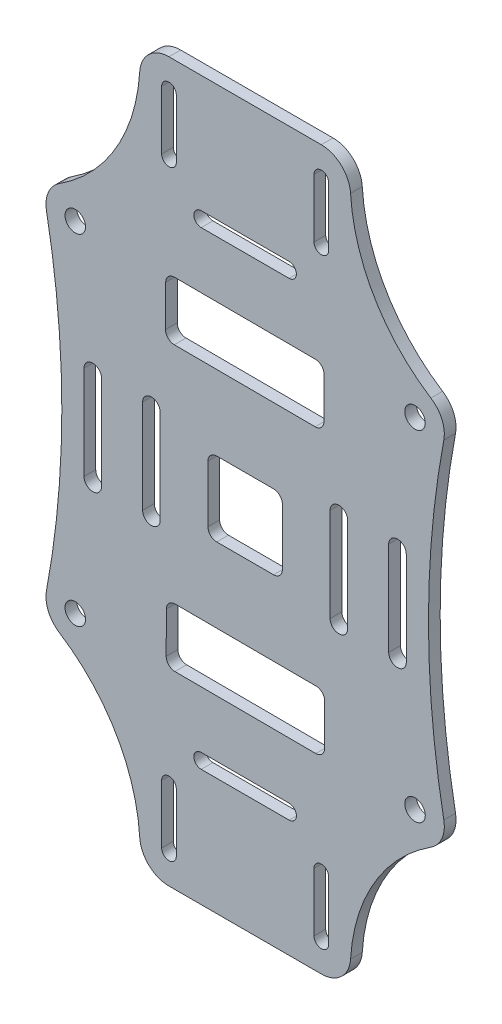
ISO-10303-21;
HEADER;
FILE_DESCRIPTION(('STEP AP214'),'2;1');
FILE_NAME('part.step','',(''),(''),'','','');
FILE_SCHEMA(('AUTOMOTIVE_DESIGN { 1 0 10303 214 1 1 1 1 }'));
ENDSEC;
DATA;
#1=APPLICATION_CONTEXT('core data for automotive mechanical design processes');
#2=APPLICATION_PROTOCOL_DEFINITION('international standard','automotive_design',2000,#1);
#3=PRODUCT_CONTEXT('',#1,'mechanical');
#4=PRODUCT('Part','Part','',(#3));
#5=PRODUCT_RELATED_PRODUCT_CATEGORY('part','',(#4));
#6=PRODUCT_DEFINITION_FORMATION('','',#4);
#7=PRODUCT_DEFINITION_CONTEXT('part definition',#1,'design');
#8=PRODUCT_DEFINITION('design','',#6,#7);
#9=PRODUCT_DEFINITION_SHAPE('','',#8);
#10=(LENGTH_UNIT() NAMED_UNIT(*) SI_UNIT(.MILLI.,.METRE.));
#11=(NAMED_UNIT(*) PLANE_ANGLE_UNIT() SI_UNIT($,.RADIAN.));
#12=(NAMED_UNIT(*) SI_UNIT($,.STERADIAN.) SOLID_ANGLE_UNIT());
#13=UNCERTAINTY_MEASURE_WITH_UNIT(LENGTH_MEASURE(1.E-05),#10,'distance_accuracy_value','');
#14=(GEOMETRIC_REPRESENTATION_CONTEXT(3) GLOBAL_UNCERTAINTY_ASSIGNED_CONTEXT((#13)) GLOBAL_UNIT_ASSIGNED_CONTEXT((#10,
#11,#12)) REPRESENTATION_CONTEXT('',''));
#15=CARTESIAN_POINT('',(0.,0.,0.));
#16=DIRECTION('',(0.,0.,1.));
#17=DIRECTION('',(1.,0.,0.));
#18=AXIS2_PLACEMENT_3D('',#15,#16,#17);
#19=CARTESIAN_POINT('',(13.0000000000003,56.2846009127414,2.));
#20=DIRECTION('',(0.,0.,1.));
#21=DIRECTION('',(1.,0.,0.));
#22=AXIS2_PLACEMENT_3D('',#19,#20,#21);
#23=PLANE('',#22);
#24=DIRECTION('',(-1.,0.,0.));
#25=VECTOR('',#24,1.);
#26=CARTESIAN_POINT('',(0.,-38.7846009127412,2.));
#27=LINE('',#26,#25);
#28=CARTESIAN_POINT('',(7.49999999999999,-38.7846009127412,2.));
#29=VERTEX_POINT('',#28);
#30=CARTESIAN_POINT('',(-7.5,-38.7846009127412,2.));
#31=VERTEX_POINT('',#30);
#32=EDGE_CURVE('E606',#29,#31,#27,.T.);
#33=ORIENTED_EDGE('',*,*,#32,.F.);
#34=CARTESIAN_POINT('',(7.49999999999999,-40.0346009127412,2.));
#35=DIRECTION('',(0.,0.,1.));
#36=DIRECTION('',(1.,0.,0.));
#37=AXIS2_PLACEMENT_3D('',#34,#35,#36);
#38=CIRCLE('',#37,1.25);
#39=CARTESIAN_POINT('',(7.49999999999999,-41.2846009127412,2.));
#40=VERTEX_POINT('',#39);
#41=EDGE_CURVE('E603',#40,#29,#38,.T.);
#42=ORIENTED_EDGE('',*,*,#41,.F.);
#43=DIRECTION('',(1.,0.,0.));
#44=VECTOR('',#43,1.);
#45=CARTESIAN_POINT('',(0.,-41.2846009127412,2.));
#46=LINE('',#45,#44);
#47=CARTESIAN_POINT('',(-7.5,-41.2846009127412,2.));
#48=VERTEX_POINT('',#47);
#49=EDGE_CURVE('E601',#48,#40,#46,.T.);
#50=ORIENTED_EDGE('',*,*,#49,.F.);
#51=CARTESIAN_POINT('',(-7.5,-40.0346009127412,2.));
#52=DIRECTION('',(0.,0.,1.));
#53=DIRECTION('',(-1.,0.,0.));
#54=AXIS2_PLACEMENT_3D('',#51,#52,#53);
#55=CIRCLE('',#54,1.25);
#56=EDGE_CURVE('E608',#31,#48,#55,.T.);
#57=ORIENTED_EDGE('',*,*,#56,.F.);
#58=EDGE_LOOP('',(#33,#42,#50,#57));
#59=FACE_BOUND('',#58,.T.);
#60=DIRECTION('',(-0.00420017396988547,-0.999991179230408,0.));
#61=VECTOR('',#60,1.);
#62=CARTESIAN_POINT('',(-13.4752390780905,-27.5647288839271,2.));
#63=LINE('',#62,#61);
#64=CARTESIAN_POINT('',(-13.4458378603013,-20.5647906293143,2.));
#65=VERTEX_POINT('',#64);
#66=CARTESIAN_POINT('',(-13.4752390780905,-27.5647288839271,2.));
#67=VERTEX_POINT('',#66);
#68=EDGE_CURVE('E663',#65,#67,#63,.T.);
#69=ORIENTED_EDGE('',*,*,#68,.F.);
#70=CARTESIAN_POINT('',(-11.9458510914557,-20.5710908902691,2.));
#71=DIRECTION('',(0.,0.,1.));
#72=DIRECTION('',(1.,0.,0.));
#73=AXIS2_PLACEMENT_3D('',#70,#71,#72);
#74=CIRCLE('',#73,1.5);
#75=CARTESIAN_POINT('',(-11.9395508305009,-19.0711041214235,2.));
#76=VERTEX_POINT('',#75);
#77=EDGE_CURVE('E661',#76,#65,#74,.T.);
#78=ORIENTED_EDGE('',*,*,#77,.F.);
#79=DIRECTION('',(-0.999991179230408,0.00420017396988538,0.));
#80=VECTOR('',#79,1.);
#81=CARTESIAN_POINT('',(-11.9395508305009,-19.0711041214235,2.));
#82=LINE('',#81,#80);
#83=CARTESIAN_POINT('',(12.0927132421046,-19.1720447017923,2.));
#84=VERTEX_POINT('',#83);
#85=EDGE_CURVE('E677',#84,#76,#82,.T.);
#86=ORIENTED_EDGE('',*,*,#85,.F.);
#87=CARTESIAN_POINT('',(12.0864129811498,-20.6720314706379,2.));
#88=DIRECTION('',(0.,0.,1.));
#89=DIRECTION('',(1.,0.,0.));
#90=AXIS2_PLACEMENT_3D('',#87,#88,#89);
#91=CIRCLE('',#90,1.5);
#92=CARTESIAN_POINT('',(13.5863997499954,-20.6783317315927,2.));
#93=VERTEX_POINT('',#92);
#94=EDGE_CURVE('E674',#93,#84,#91,.T.);
#95=ORIENTED_EDGE('',*,*,#94,.F.);
#96=DIRECTION('',(0.00420017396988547,0.999991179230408,0.));
#97=VECTOR('',#96,1.);
#98=CARTESIAN_POINT('',(13.5569985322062,-27.6782699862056,2.));
#99=LINE('',#98,#97);
#100=CARTESIAN_POINT('',(13.5569985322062,-27.6782699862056,2.));
#101=VERTEX_POINT('',#100);
#102=EDGE_CURVE('E672',#101,#93,#99,.T.);
#103=ORIENTED_EDGE('',*,*,#102,.F.);
#104=CARTESIAN_POINT('',(12.0570117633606,-27.6719697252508,2.));
#105=DIRECTION('',(0.,0.,1.));
#106=DIRECTION('',(1.,0.,0.));
#107=AXIS2_PLACEMENT_3D('',#104,#105,#106);
#108=CIRCLE('',#107,1.5);
#109=CARTESIAN_POINT('',(12.0507115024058,-29.1719564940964,2.));
#110=VERTEX_POINT('',#109);
#111=EDGE_CURVE('E670',#110,#101,#108,.T.);
#112=ORIENTED_EDGE('',*,*,#111,.F.);
#113=DIRECTION('',(0.999991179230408,-0.00420017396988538,0.));
#114=VECTOR('',#113,1.);
#115=CARTESIAN_POINT('',(-11.9815525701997,-29.0710159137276,2.));
#116=LINE('',#115,#114);
#117=CARTESIAN_POINT('',(-11.9815525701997,-29.0710159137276,2.));
#118=VERTEX_POINT('',#117);
#119=EDGE_CURVE('E668',#118,#110,#116,.T.);
#120=ORIENTED_EDGE('',*,*,#119,.F.);
#121=CARTESIAN_POINT('',(-11.9752523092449,-27.571029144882,2.));
#122=DIRECTION('',(0.,0.,1.));
#123=DIRECTION('',(1.,0.,0.));
#124=AXIS2_PLACEMENT_3D('',#121,#122,#123);
#125=CIRCLE('',#124,1.5);
#126=EDGE_CURVE('E666',#67,#118,#125,.T.);
#127=ORIENTED_EDGE('',*,*,#126,.F.);
#128=EDGE_LOOP('',(#69,#78,#86,#95,#103,#112,#120,#127));
#129=FACE_BOUND('',#128,.T.);
#130=CARTESIAN_POINT('',(-16.,8.,2.));
#131=DIRECTION('',(0.,0.,1.));
#132=DIRECTION('',(1.,0.,0.));
#133=AXIS2_PLACEMENT_3D('',#130,#131,#132);
#134=CIRCLE('',#133,1.5);
#135=CARTESIAN_POINT('',(-14.5,8.,2.));
#136=VERTEX_POINT('',#135);
#137=CARTESIAN_POINT('',(-17.5,8.,2.));
#138=VERTEX_POINT('',#137);
#139=EDGE_CURVE('E752',#136,#138,#134,.T.);
#140=ORIENTED_EDGE('',*,*,#139,.F.);
#141=DIRECTION('',(0.,1.,0.));
#142=VECTOR('',#141,1.);
#143=CARTESIAN_POINT('',(-14.5,0.,2.));
#144=LINE('',#143,#142);
#145=CARTESIAN_POINT('',(-14.5,-8.,2.));
#146=VERTEX_POINT('',#145);
#147=EDGE_CURVE('E750',#146,#136,#144,.T.);
#148=ORIENTED_EDGE('',*,*,#147,.F.);
#149=CARTESIAN_POINT('',(-16.,-8.,2.));
#150=DIRECTION('',(0.,0.,1.));
#151=DIRECTION('',(1.,0.,0.));
#152=AXIS2_PLACEMENT_3D('',#149,#150,#151);
#153=CIRCLE('',#152,1.5);
#154=CARTESIAN_POINT('',(-17.5,-8.,2.));
#155=VERTEX_POINT('',#154);
#156=EDGE_CURVE('E758',#155,#146,#153,.T.);
#157=ORIENTED_EDGE('',*,*,#156,.F.);
#158=DIRECTION('',(0.,-1.,0.));
#159=VECTOR('',#158,1.);
#160=CARTESIAN_POINT('',(-17.5,0.,2.));
#161=LINE('',#160,#159);
#162=EDGE_CURVE('E755',#138,#155,#161,.T.);
#163=ORIENTED_EDGE('',*,*,#162,.F.);
#164=EDGE_LOOP('',(#140,#148,#157,#163));
#165=FACE_BOUND('',#164,.T.);
#166=CARTESIAN_POINT('',(26.,8.,2.));
#167=DIRECTION('',(0.,0.,1.));
#168=DIRECTION('',(1.,0.,0.));
#169=AXIS2_PLACEMENT_3D('',#166,#167,#168);
#170=CIRCLE('',#169,1.5);
#171=CARTESIAN_POINT('',(27.5,8.,2.));
#172=VERTEX_POINT('',#171);
#173=CARTESIAN_POINT('',(24.5,8.,2.));
#174=VERTEX_POINT('',#173);
#175=EDGE_CURVE('E812',#172,#174,#170,.T.);
#176=ORIENTED_EDGE('',*,*,#175,.F.);
#177=DIRECTION('',(0.,1.,0.));
#178=VECTOR('',#177,1.);
#179=CARTESIAN_POINT('',(27.5,0.,2.));
#180=LINE('',#179,#178);
#181=CARTESIAN_POINT('',(27.5,-8.,2.));
#182=VERTEX_POINT('',#181);
#183=EDGE_CURVE('E810',#182,#172,#180,.T.);
#184=ORIENTED_EDGE('',*,*,#183,.F.);
#185=CARTESIAN_POINT('',(26.,-8.,2.));
#186=DIRECTION('',(0.,0.,1.));
#187=DIRECTION('',(1.,0.,0.));
#188=AXIS2_PLACEMENT_3D('',#185,#186,#187);
#189=CIRCLE('',#188,1.5);
#190=CARTESIAN_POINT('',(24.5,-8.,2.));
#191=VERTEX_POINT('',#190);
#192=EDGE_CURVE('E818',#191,#182,#189,.T.);
#193=ORIENTED_EDGE('',*,*,#192,.F.);
#194=DIRECTION('',(0.,-1.,0.));
#195=VECTOR('',#194,1.);
#196=CARTESIAN_POINT('',(24.5,0.,2.));
#197=LINE('',#196,#195);
#198=EDGE_CURVE('E815',#174,#191,#197,.T.);
#199=ORIENTED_EDGE('',*,*,#198,.F.);
#200=EDGE_LOOP('',(#176,#184,#193,#199));
#201=FACE_BOUND('',#200,.T.);
#202=DIRECTION('',(0.,1.,0.));
#203=VECTOR('',#202,1.);
#204=CARTESIAN_POINT('',(14.2500000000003,-56.2846009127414,2.));
#205=LINE('',#204,#203);
#206=CARTESIAN_POINT('',(14.2500000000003,-56.2846009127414,2.));
#207=VERTEX_POINT('',#206);
#208=CARTESIAN_POINT('',(14.2499999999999,-46.2846009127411,2.));
#209=VERTEX_POINT('',#208);
#210=EDGE_CURVE('E901',#207,#209,#205,.T.);
#211=ORIENTED_EDGE('',*,*,#210,.F.);
#212=CARTESIAN_POINT('',(13.0000000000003,-56.2846009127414,2.));
#213=DIRECTION('',(0.,0.,1.));
#214=DIRECTION('',(1.,0.,0.));
#215=AXIS2_PLACEMENT_3D('',#212,#213,#214);
#216=CIRCLE('',#215,1.25);
#217=CARTESIAN_POINT('',(11.7500000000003,-56.2846009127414,2.));
#218=VERTEX_POINT('',#217);
#219=EDGE_CURVE('E899',#218,#207,#216,.T.);
#220=ORIENTED_EDGE('',*,*,#219,.F.);
#221=DIRECTION('',(0.,-1.,0.));
#222=VECTOR('',#221,1.);
#223=CARTESIAN_POINT('',(11.7500000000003,-56.2846009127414,2.));
#224=LINE('',#223,#222);
#225=CARTESIAN_POINT('',(11.7499999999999,-46.2846009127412,2.));
#226=VERTEX_POINT('',#225);
#227=EDGE_CURVE('E907',#226,#218,#224,.T.);
#228=ORIENTED_EDGE('',*,*,#227,.F.);
#229=CARTESIAN_POINT('',(12.9999999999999,-46.2846009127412,2.));
#230=DIRECTION('',(0.,0.,1.));
#231=DIRECTION('',(1.,0.,0.));
#232=AXIS2_PLACEMENT_3D('',#229,#230,#231);
#233=CIRCLE('',#232,1.25);
#234=EDGE_CURVE('E904',#209,#226,#233,.T.);
#235=ORIENTED_EDGE('',*,*,#234,.F.);
#236=EDGE_LOOP('',(#211,#220,#228,#235));
#237=FACE_BOUND('',#236,.T.);
#238=DIRECTION('',(0.,-1.,0.));
#239=VECTOR('',#238,1.);
#240=CARTESIAN_POINT('',(11.7500000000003,56.2846009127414,2.));
#241=LINE('',#240,#239);
#242=CARTESIAN_POINT('',(11.7500000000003,56.2846009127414,2.));
#243=VERTEX_POINT('',#242);
#244=CARTESIAN_POINT('',(11.7499999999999,46.2846009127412,2.));
#245=VERTEX_POINT('',#244);
#246=EDGE_CURVE('E963',#243,#245,#241,.T.);
#247=ORIENTED_EDGE('',*,*,#246,.F.);
#248=CARTESIAN_POINT('',(13.0000000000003,56.2846009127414,2.));
#249=DIRECTION('',(0.,0.,1.));
#250=DIRECTION('',(1.,0.,0.));
#251=AXIS2_PLACEMENT_3D('',#248,#249,#250);
#252=CIRCLE('',#251,1.25);
#253=CARTESIAN_POINT('',(14.2500000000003,56.2846009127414,2.));
#254=VERTEX_POINT('',#253);
#255=EDGE_CURVE('E961',#254,#243,#252,.T.);
#256=ORIENTED_EDGE('',*,*,#255,.F.);
#257=DIRECTION('',(0.,1.,0.));
#258=VECTOR('',#257,1.);
#259=CARTESIAN_POINT('',(14.2500000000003,56.2846009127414,2.));
#260=LINE('',#259,#258);
#261=CARTESIAN_POINT('',(14.2499999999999,46.2846009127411,2.));
#262=VERTEX_POINT('',#261);
#263=EDGE_CURVE('E969',#262,#254,#260,.T.);
#264=ORIENTED_EDGE('',*,*,#263,.F.);
#265=CARTESIAN_POINT('',(12.9999999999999,46.2846009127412,2.));
#266=DIRECTION('',(0.,0.,1.));
#267=DIRECTION('',(1.,0.,0.));
#268=AXIS2_PLACEMENT_3D('',#265,#266,#267);
#269=CIRCLE('',#268,1.25);
#270=EDGE_CURVE('E966',#245,#262,#269,.T.);
#271=ORIENTED_EDGE('',*,*,#270,.F.);
#272=EDGE_LOOP('',(#247,#256,#264,#271));
#273=FACE_BOUND('',#272,.T.);
#274=CARTESIAN_POINT('',(-28.9913780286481,28.9913780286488,2.));
#275=DIRECTION('',(0.,0.,1.));
#276=DIRECTION('',(1.,0.,0.));
#277=AXIS2_PLACEMENT_3D('',#274,#275,#276);
#278=CIRCLE('',#277,1.75);
#279=CARTESIAN_POINT('',(-27.2413780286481,28.9913780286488,2.));
#280=VERTEX_POINT('',#279);
#281=EDGE_CURVE('E1023',#280,#280,#278,.T.);
#282=ORIENTED_EDGE('',*,*,#281,.F.);
#283=EDGE_LOOP('',(#282));
#284=FACE_BOUND('',#283,.T.);
#285=CARTESIAN_POINT('',(28.9913780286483,-28.9913780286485,2.));
#286=DIRECTION('',(0.,0.,1.));
#287=DIRECTION('',(1.,0.,0.));
#288=AXIS2_PLACEMENT_3D('',#285,#286,#287);
#289=CIRCLE('',#288,1.75);
#290=CARTESIAN_POINT('',(30.7413780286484,-28.9913780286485,2.));
#291=VERTEX_POINT('',#290);
#292=EDGE_CURVE('E1035',#291,#291,#289,.T.);
#293=ORIENTED_EDGE('',*,*,#292,.F.);
#294=EDGE_LOOP('',(#293));
#295=FACE_BOUND('',#294,.T.);
#296=CARTESIAN_POINT('',(28.9913780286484,28.9913780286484,2.));
#297=DIRECTION('',(0.,0.,1.));
#298=DIRECTION('',(1.,0.,0.));
#299=AXIS2_PLACEMENT_3D('',#296,#297,#298);
#300=CIRCLE('',#299,4.99999999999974);
#301=CARTESIAN_POINT('',(33.9049612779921,28.0657973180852,2.));
#302=VERTEX_POINT('',#301);
#303=CARTESIAN_POINT('',(31.6975648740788,33.1957272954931,2.));
#304=VERTEX_POINT('',#303);
#305=EDGE_CURVE('E1073',#302,#304,#300,.T.);
#306=ORIENTED_EDGE('',*,*,#305,.T.);
#307=CARTESIAN_POINT('',(47.9346859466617,58.4218228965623,2.));
#308=DIRECTION('',(0.,0.,1.));
#309=DIRECTION('',(1.,0.,0.));
#310=AXIS2_PLACEMENT_3D('',#307,#308,#309);
#311=CIRCLE('',#310,30.);
#312=CARTESIAN_POINT('',(17.9906694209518,56.5899183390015,2.));
#313=VERTEX_POINT('',#312);
#314=EDGE_CURVE('E11',#304,#313,#311,.F.);
#315=ORIENTED_EDGE('',*,*,#314,.T.);
#316=CARTESIAN_POINT('',(13.0000000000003,56.2846009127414,2.));
#317=DIRECTION('',(0.,0.,1.));
#318=DIRECTION('',(1.,0.,0.));
#319=AXIS2_PLACEMENT_3D('',#316,#317,#318);
#320=CIRCLE('',#319,4.99999999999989);
#321=CARTESIAN_POINT('',(13.,61.2846009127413,2.));
#322=VERTEX_POINT('',#321);
#323=EDGE_CURVE('E1047',#313,#322,#320,.T.);
#324=ORIENTED_EDGE('',*,*,#323,.T.);
#325=DIRECTION('',(-1.,0.,0.));
#326=VECTOR('',#325,1.);
#327=CARTESIAN_POINT('',(-12.9999999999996,61.2846009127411,2.));
#328=LINE('',#327,#326);
#329=CARTESIAN_POINT('',(-12.9999999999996,61.2846009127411,2.));
#330=VERTEX_POINT('',#329);
#331=EDGE_CURVE('E1049',#322,#330,#328,.T.);
#332=ORIENTED_EDGE('',*,*,#331,.T.);
#333=CARTESIAN_POINT('',(-13.,56.2846009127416,2.));
#334=DIRECTION('',(0.,0.,1.));
#335=DIRECTION('',(1.,0.,0.));
#336=AXIS2_PLACEMENT_3D('',#333,#334,#335);
#337=CIRCLE('',#336,4.99999999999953);
#338=CARTESIAN_POINT('',(-17.9906694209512,56.5899183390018,2.));
#339=VERTEX_POINT('',#338);
#340=EDGE_CURVE('E1052',#330,#339,#337,.T.);
#341=ORIENTED_EDGE('',*,*,#340,.T.);
#342=CARTESIAN_POINT('',(-47.934685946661,58.4218228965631,2.));
#343=DIRECTION('',(0.,0.,1.));
#344=DIRECTION('',(1.,0.,0.));
#345=AXIS2_PLACEMENT_3D('',#342,#343,#344);
#346=CIRCLE('',#345,30.);
#347=CARTESIAN_POINT('',(-31.6975648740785,33.1957272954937,2.));
#348=VERTEX_POINT('',#347);
#349=EDGE_CURVE('E1153',#339,#348,#346,.F.);
#350=ORIENTED_EDGE('',*,*,#349,.T.);
#351=CARTESIAN_POINT('',(-28.9913780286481,28.9913780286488,2.));
#352=DIRECTION('',(0.,0.,1.));
#353=DIRECTION('',(1.,0.,0.));
#354=AXIS2_PLACEMENT_3D('',#351,#352,#353);
#355=CIRCLE('',#354,4.99999999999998);
#356=CARTESIAN_POINT('',(-33.904961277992,28.0657973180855,2.));
#357=VERTEX_POINT('',#356);
#358=EDGE_CURVE('E1055',#348,#357,#355,.T.);
#359=ORIENTED_EDGE('',*,*,#358,.T.);
#360=CARTESIAN_POINT('',(-182.896432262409,1.59775657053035E-12,2.));
#361=DIRECTION('',(0.,0.,-1.));
#362=DIRECTION('',(1.,0.,0.));
#363=AXIS2_PLACEMENT_3D('',#360,#361,#362);
#364=CIRCLE('',#363,151.611831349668);
#365=CARTESIAN_POINT('',(-33.9049612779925,-28.0657973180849,2.));
#366=VERTEX_POINT('',#365);
#367=EDGE_CURVE('E1057',#357,#366,#364,.T.);
#368=ORIENTED_EDGE('',*,*,#367,.T.);
#369=CARTESIAN_POINT('',(-28.9913780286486,-28.9913780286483,2.));
#370=DIRECTION('',(0.,0.,1.));
#371=DIRECTION('',(1.,0.,0.));
#372=AXIS2_PLACEMENT_3D('',#369,#370,#371);
#373=CIRCLE('',#372,4.99999999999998);
#374=CARTESIAN_POINT('',(-31.697564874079,-33.1957272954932,2.));
#375=VERTEX_POINT('',#374);
#376=EDGE_CURVE('E1059',#366,#375,#373,.T.);
#377=ORIENTED_EDGE('',*,*,#376,.T.);
#378=CARTESIAN_POINT('',(-47.9346859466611,-58.421822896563,2.));
#379=DIRECTION('',(0.,0.,1.));
#380=DIRECTION('',(1.,0.,0.));
#381=AXIS2_PLACEMENT_3D('',#378,#379,#380);
#382=CIRCLE('',#381,30.);
#383=CARTESIAN_POINT('',(-17.9906694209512,-56.5899183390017,2.));
#384=VERTEX_POINT('',#383);
#385=EDGE_CURVE('E1149',#375,#384,#382,.F.);
#386=ORIENTED_EDGE('',*,*,#385,.T.);
#387=CARTESIAN_POINT('',(-13.,-56.2846009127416,2.));
#388=DIRECTION('',(0.,0.,1.));
#389=DIRECTION('',(1.,0.,0.));
#390=AXIS2_PLACEMENT_3D('',#387,#388,#389);
#391=CIRCLE('',#390,4.99999999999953);
#392=CARTESIAN_POINT('',(-12.9999999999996,-61.2846009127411,2.));
#393=VERTEX_POINT('',#392);
#394=EDGE_CURVE('E1062',#384,#393,#391,.T.);
#395=ORIENTED_EDGE('',*,*,#394,.T.);
#396=DIRECTION('',(1.,0.,0.));
#397=VECTOR('',#396,1.);
#398=CARTESIAN_POINT('',(-12.9999999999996,-61.2846009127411,2.));
#399=LINE('',#398,#397);
#400=CARTESIAN_POINT('',(13.,-61.2846009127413,2.));
#401=VERTEX_POINT('',#400);
#402=EDGE_CURVE('E1064',#393,#401,#399,.T.);
#403=ORIENTED_EDGE('',*,*,#402,.T.);
#404=CARTESIAN_POINT('',(13.0000000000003,-56.2846009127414,2.));
#405=DIRECTION('',(0.,0.,1.));
#406=DIRECTION('',(1.,0.,0.));
#407=AXIS2_PLACEMENT_3D('',#404,#405,#406);
#408=CIRCLE('',#407,4.99999999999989);
#409=CARTESIAN_POINT('',(17.9906694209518,-56.5899183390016,2.));
#410=VERTEX_POINT('',#409);
#411=EDGE_CURVE('E1066',#401,#410,#408,.T.);
#412=ORIENTED_EDGE('',*,*,#411,.T.);
#413=CARTESIAN_POINT('',(47.9346859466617,-58.4218228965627,2.));
#414=DIRECTION('',(0.,0.,1.));
#415=DIRECTION('',(1.,0.,0.));
#416=AXIS2_PLACEMENT_3D('',#413,#414,#415);
#417=CIRCLE('',#416,30.);
#418=CARTESIAN_POINT('',(31.6975648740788,-33.1957272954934,2.));
#419=VERTEX_POINT('',#418);
#420=EDGE_CURVE('E1145',#410,#419,#417,.F.);
#421=ORIENTED_EDGE('',*,*,#420,.T.);
#422=CARTESIAN_POINT('',(28.9913780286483,-28.9913780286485,2.));
#423=DIRECTION('',(0.,0.,1.));
#424=DIRECTION('',(1.,0.,0.));
#425=AXIS2_PLACEMENT_3D('',#422,#423,#424);
#426=CIRCLE('',#425,4.99999999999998);
#427=CARTESIAN_POINT('',(33.9049612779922,-28.0657973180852,2.));
#428=VERTEX_POINT('',#427);
#429=EDGE_CURVE('E1069',#419,#428,#426,.T.);
#430=ORIENTED_EDGE('',*,*,#429,.T.);
#431=CARTESIAN_POINT('',(182.896432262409,-3.20597610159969E-13,2.));
#432=DIRECTION('',(0.,0.,-1.));
#433=DIRECTION('',(1.,0.,0.));
#434=AXIS2_PLACEMENT_3D('',#431,#432,#433);
#435=CIRCLE('',#434,151.611831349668);
#436=EDGE_CURVE('E1071',#428,#302,#435,.T.);
#437=ORIENTED_EDGE('',*,*,#436,.T.);
#438=EDGE_LOOP('',(#306,#315,#324,#332,#341,#350,#359,#368,#377,#386,#395,#403,#412,#421,#430,#437));
#439=FACE_BOUND('',#438,.T.);
#440=CARTESIAN_POINT('',(28.9913780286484,28.9913780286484,2.));
#441=DIRECTION('',(0.,0.,1.));
#442=DIRECTION('',(1.,0.,0.));
#443=AXIS2_PLACEMENT_3D('',#440,#441,#442);
#444=CIRCLE('',#443,1.75);
#445=CARTESIAN_POINT('',(30.7413780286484,28.9913780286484,2.));
#446=VERTEX_POINT('',#445);
#447=EDGE_CURVE('E1041',#446,#446,#444,.T.);
#448=ORIENTED_EDGE('',*,*,#447,.F.);
#449=EDGE_LOOP('',(#448));
#450=FACE_BOUND('',#449,.T.);
#451=CARTESIAN_POINT('',(-28.9913780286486,-28.9913780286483,2.));
#452=DIRECTION('',(0.,0.,1.));
#453=DIRECTION('',(1.,0.,0.));
#454=AXIS2_PLACEMENT_3D('',#451,#452,#453);
#455=CIRCLE('',#454,1.75);
#456=CARTESIAN_POINT('',(-27.2413780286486,-28.9913780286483,2.));
#457=VERTEX_POINT('',#456);
#458=EDGE_CURVE('E1029',#457,#457,#455,.T.);
#459=ORIENTED_EDGE('',*,*,#458,.F.);
#460=EDGE_LOOP('',(#459));
#461=FACE_BOUND('',#460,.T.);
#462=DIRECTION('',(0.,-1.,0.));
#463=VECTOR('',#462,1.);
#464=CARTESIAN_POINT('',(-14.25,56.2846009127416,2.));
#465=LINE('',#464,#463);
#466=CARTESIAN_POINT('',(-14.25,56.2846009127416,2.));
#467=VERTEX_POINT('',#466);
#468=CARTESIAN_POINT('',(-14.2499999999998,46.2846009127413,2.));
#469=VERTEX_POINT('',#468);
#470=EDGE_CURVE('E994',#467,#469,#465,.T.);
#471=ORIENTED_EDGE('',*,*,#470,.F.);
#472=CARTESIAN_POINT('',(-13.,56.2846009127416,2.));
#473=DIRECTION('',(0.,0.,1.));
#474=DIRECTION('',(1.,0.,0.));
#475=AXIS2_PLACEMENT_3D('',#472,#473,#474);
#476=CIRCLE('',#475,1.25);
#477=CARTESIAN_POINT('',(-11.75,56.2846009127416,2.));
#478=VERTEX_POINT('',#477);
#479=EDGE_CURVE('E992',#478,#467,#476,.T.);
#480=ORIENTED_EDGE('',*,*,#479,.F.);
#481=DIRECTION('',(0.,1.,0.));
#482=VECTOR('',#481,1.);
#483=CARTESIAN_POINT('',(-11.75,56.2846009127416,2.));
#484=LINE('',#483,#482);
#485=CARTESIAN_POINT('',(-11.7499999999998,46.2846009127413,2.));
#486=VERTEX_POINT('',#485);
#487=EDGE_CURVE('E1000',#486,#478,#484,.T.);
#488=ORIENTED_EDGE('',*,*,#487,.F.);
#489=CARTESIAN_POINT('',(-12.9999999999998,46.2846009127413,2.));
#490=DIRECTION('',(0.,0.,1.));
#491=DIRECTION('',(1.,0.,0.));
#492=AXIS2_PLACEMENT_3D('',#489,#490,#491);
#493=CIRCLE('',#492,1.25);
#494=EDGE_CURVE('E997',#469,#486,#493,.T.);
#495=ORIENTED_EDGE('',*,*,#494,.F.);
#496=EDGE_LOOP('',(#471,#480,#488,#495));
#497=FACE_BOUND('',#496,.T.);
#498=DIRECTION('',(0.,1.,0.));
#499=VECTOR('',#498,1.);
#500=CARTESIAN_POINT('',(-11.75,-56.2846009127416,2.));
#501=LINE('',#500,#499);
#502=CARTESIAN_POINT('',(-11.75,-56.2846009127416,2.));
#503=VERTEX_POINT('',#502);
#504=CARTESIAN_POINT('',(-11.7499999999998,-46.2846009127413,2.));
#505=VERTEX_POINT('',#504);
#506=EDGE_CURVE('E932',#503,#505,#501,.T.);
#507=ORIENTED_EDGE('',*,*,#506,.F.);
#508=CARTESIAN_POINT('',(-13.,-56.2846009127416,2.));
#509=DIRECTION('',(0.,0.,1.));
#510=DIRECTION('',(1.,0.,0.));
#511=AXIS2_PLACEMENT_3D('',#508,#509,#510);
#512=CIRCLE('',#511,1.25);
#513=CARTESIAN_POINT('',(-14.25,-56.2846009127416,2.));
#514=VERTEX_POINT('',#513);
#515=EDGE_CURVE('E930',#514,#503,#512,.T.);
#516=ORIENTED_EDGE('',*,*,#515,.F.);
#517=DIRECTION('',(0.,-1.,0.));
#518=VECTOR('',#517,1.);
#519=CARTESIAN_POINT('',(-14.25,-56.2846009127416,2.));
#520=LINE('',#519,#518);
#521=CARTESIAN_POINT('',(-14.2499999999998,-46.2846009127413,2.));
#522=VERTEX_POINT('',#521);
#523=EDGE_CURVE('E938',#522,#514,#520,.T.);
#524=ORIENTED_EDGE('',*,*,#523,.F.);
#525=CARTESIAN_POINT('',(-12.9999999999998,-46.2846009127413,2.));
#526=DIRECTION('',(0.,0.,1.));
#527=DIRECTION('',(1.,0.,0.));
#528=AXIS2_PLACEMENT_3D('',#525,#526,#527);
#529=CIRCLE('',#528,1.25);
#530=EDGE_CURVE('E935',#505,#522,#529,.T.);
#531=ORIENTED_EDGE('',*,*,#530,.F.);
#532=EDGE_LOOP('',(#507,#516,#524,#531));
#533=FACE_BOUND('',#532,.T.);
#534=DIRECTION('',(-0.00420017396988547,-0.999991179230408,0.));
#535=VECTOR('',#534,1.);
#536=CARTESIAN_POINT('',(-13.5863997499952,20.6783317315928,2.));
#537=LINE('',#536,#535);
#538=CARTESIAN_POINT('',(-13.556998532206,27.6782699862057,2.));
#539=VERTEX_POINT('',#538);
#540=CARTESIAN_POINT('',(-13.5863997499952,20.6783317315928,2.));
#541=VERTEX_POINT('',#540);
#542=EDGE_CURVE('E842',#539,#541,#537,.T.);
#543=ORIENTED_EDGE('',*,*,#542,.F.);
#544=CARTESIAN_POINT('',(-12.0570117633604,27.6719697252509,2.));
#545=DIRECTION('',(0.,0.,1.));
#546=DIRECTION('',(1.,0.,0.));
#547=AXIS2_PLACEMENT_3D('',#544,#545,#546);
#548=CIRCLE('',#547,1.5);
#549=CARTESIAN_POINT('',(-12.0507115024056,29.1719564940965,2.));
#550=VERTEX_POINT('',#549);
#551=EDGE_CURVE('E840',#550,#539,#548,.T.);
#552=ORIENTED_EDGE('',*,*,#551,.F.);
#553=DIRECTION('',(-0.999991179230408,0.00420017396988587,0.));
#554=VECTOR('',#553,1.);
#555=CARTESIAN_POINT('',(-12.0507115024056,29.1719564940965,2.));
#556=LINE('',#555,#554);
#557=CARTESIAN_POINT('',(11.9815525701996,29.0710159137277,2.));
#558=VERTEX_POINT('',#557);
#559=EDGE_CURVE('E856',#558,#550,#556,.T.);
#560=ORIENTED_EDGE('',*,*,#559,.F.);
#561=CARTESIAN_POINT('',(11.9752523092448,27.5710291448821,2.));
#562=DIRECTION('',(0.,0.,1.));
#563=DIRECTION('',(1.,0.,0.));
#564=AXIS2_PLACEMENT_3D('',#561,#562,#563);
#565=CIRCLE('',#564,1.5);
#566=CARTESIAN_POINT('',(13.4752390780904,27.5647288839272,2.));
#567=VERTEX_POINT('',#566);
#568=EDGE_CURVE('E853',#567,#558,#565,.T.);
#569=ORIENTED_EDGE('',*,*,#568,.F.);
#570=DIRECTION('',(0.00420017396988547,0.999991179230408,0.));
#571=VECTOR('',#570,1.);
#572=CARTESIAN_POINT('',(13.4458378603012,20.5647906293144,2.));
#573=LINE('',#572,#571);
#574=CARTESIAN_POINT('',(13.4458378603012,20.5647906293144,2.));
#575=VERTEX_POINT('',#574);
#576=EDGE_CURVE('E851',#575,#567,#573,.T.);
#577=ORIENTED_EDGE('',*,*,#576,.F.);
#578=CARTESIAN_POINT('',(11.9458510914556,20.5710908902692,2.));
#579=DIRECTION('',(0.,0.,1.));
#580=DIRECTION('',(1.,0.,0.));
#581=AXIS2_PLACEMENT_3D('',#578,#579,#580);
#582=CIRCLE('',#581,1.5);
#583=CARTESIAN_POINT('',(11.9395508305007,19.0711041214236,2.));
#584=VERTEX_POINT('',#583);
#585=EDGE_CURVE('E849',#584,#575,#582,.T.);
#586=ORIENTED_EDGE('',*,*,#585,.F.);
#587=DIRECTION('',(0.999991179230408,-0.00420017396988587,0.));
#588=VECTOR('',#587,1.);
#589=CARTESIAN_POINT('',(-12.0927132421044,19.1720447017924,2.));
#590=LINE('',#589,#588);
#591=CARTESIAN_POINT('',(-12.0927132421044,19.1720447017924,2.));
#592=VERTEX_POINT('',#591);
#593=EDGE_CURVE('E847',#592,#584,#590,.T.);
#594=ORIENTED_EDGE('',*,*,#593,.F.);
#595=CARTESIAN_POINT('',(-12.0864129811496,20.672031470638,2.));
#596=DIRECTION('',(0.,0.,1.));
#597=DIRECTION('',(1.,0.,0.));
#598=AXIS2_PLACEMENT_3D('',#595,#596,#597);
#599=CIRCLE('',#598,1.5);
#600=EDGE_CURVE('E845',#541,#592,#599,.T.);
#601=ORIENTED_EDGE('',*,*,#600,.F.);
#602=EDGE_LOOP('',(#543,#552,#560,#569,#577,#586,#594,#601));
#603=FACE_BOUND('',#602,.T.);
#604=CARTESIAN_POINT('',(16.,8.,2.));
#605=DIRECTION('',(0.,0.,1.));
#606=DIRECTION('',(1.,0.,0.));
#607=AXIS2_PLACEMENT_3D('',#604,#605,#606);
#608=CIRCLE('',#607,1.5);
#609=CARTESIAN_POINT('',(17.5,8.,2.));
#610=VERTEX_POINT('',#609);
#611=CARTESIAN_POINT('',(14.5,8.,2.));
#612=VERTEX_POINT('',#611);
#613=EDGE_CURVE('E782',#610,#612,#608,.T.);
#614=ORIENTED_EDGE('',*,*,#613,.F.);
#615=DIRECTION('',(0.,1.,0.));
#616=VECTOR('',#615,1.);
#617=CARTESIAN_POINT('',(17.5,0.,2.));
#618=LINE('',#617,#616);
#619=CARTESIAN_POINT('',(17.5,-8.,2.));
#620=VERTEX_POINT('',#619);
#621=EDGE_CURVE('E780',#620,#610,#618,.T.);
#622=ORIENTED_EDGE('',*,*,#621,.F.);
#623=CARTESIAN_POINT('',(16.,-8.,2.));
#624=DIRECTION('',(0.,0.,1.));
#625=DIRECTION('',(1.,0.,0.));
#626=AXIS2_PLACEMENT_3D('',#623,#624,#625);
#627=CIRCLE('',#626,1.5);
#628=CARTESIAN_POINT('',(14.5,-8.,2.));
#629=VERTEX_POINT('',#628);
#630=EDGE_CURVE('E788',#629,#620,#627,.T.);
#631=ORIENTED_EDGE('',*,*,#630,.F.);
#632=DIRECTION('',(0.,-1.,0.));
#633=VECTOR('',#632,1.);
#634=CARTESIAN_POINT('',(14.5,0.,2.));
#635=LINE('',#634,#633);
#636=EDGE_CURVE('E785',#612,#629,#635,.T.);
#637=ORIENTED_EDGE('',*,*,#636,.F.);
#638=EDGE_LOOP('',(#614,#622,#631,#637));
#639=FACE_BOUND('',#638,.T.);
#640=CARTESIAN_POINT('',(-26.,8.,2.));
#641=DIRECTION('',(0.,0.,1.));
#642=DIRECTION('',(1.,0.,0.));
#643=AXIS2_PLACEMENT_3D('',#640,#641,#642);
#644=CIRCLE('',#643,1.5);
#645=CARTESIAN_POINT('',(-24.5,8.,2.));
#646=VERTEX_POINT('',#645);
#647=CARTESIAN_POINT('',(-27.5,8.,2.));
#648=VERTEX_POINT('',#647);
#649=EDGE_CURVE('E722',#646,#648,#644,.T.);
#650=ORIENTED_EDGE('',*,*,#649,.F.);
#651=DIRECTION('',(0.,1.,0.));
#652=VECTOR('',#651,1.);
#653=CARTESIAN_POINT('',(-24.5,0.,2.));
#654=LINE('',#653,#652);
#655=CARTESIAN_POINT('',(-24.5,-8.,2.));
#656=VERTEX_POINT('',#655);
#657=EDGE_CURVE('E720',#656,#646,#654,.T.);
#658=ORIENTED_EDGE('',*,*,#657,.F.);
#659=CARTESIAN_POINT('',(-26.,-8.,2.));
#660=DIRECTION('',(0.,0.,1.));
#661=DIRECTION('',(1.,0.,0.));
#662=AXIS2_PLACEMENT_3D('',#659,#660,#661);
#663=CIRCLE('',#662,1.5);
#664=CARTESIAN_POINT('',(-27.5,-8.,2.));
#665=VERTEX_POINT('',#664);
#666=EDGE_CURVE('E728',#665,#656,#663,.T.);
#667=ORIENTED_EDGE('',*,*,#666,.F.);
#668=DIRECTION('',(0.,-1.,0.));
#669=VECTOR('',#668,1.);
#670=CARTESIAN_POINT('',(-27.5,0.,2.));
#671=LINE('',#670,#669);
#672=EDGE_CURVE('E725',#648,#665,#671,.T.);
#673=ORIENTED_EDGE('',*,*,#672,.F.);
#674=EDGE_LOOP('',(#650,#658,#667,#673));
#675=FACE_BOUND('',#674,.T.);
#676=DIRECTION('',(1.,0.,0.));
#677=VECTOR('',#676,1.);
#678=CARTESIAN_POINT('',(0.,38.7846009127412,2.));
#679=LINE('',#678,#677);
#680=CARTESIAN_POINT('',(-7.5,38.7846009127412,2.));
#681=VERTEX_POINT('',#680);
#682=CARTESIAN_POINT('',(7.5,38.7846009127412,2.));
#683=VERTEX_POINT('',#682);
#684=EDGE_CURVE('E636',#681,#683,#679,.T.);
#685=ORIENTED_EDGE('',*,*,#684,.F.);
#686=CARTESIAN_POINT('',(-7.5,40.0346009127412,2.));
#687=DIRECTION('',(0.,0.,1.));
#688=DIRECTION('',(1.,0.,0.));
#689=AXIS2_PLACEMENT_3D('',#686,#687,#688);
#690=CIRCLE('',#689,1.25);
#691=CARTESIAN_POINT('',(-7.5,41.2846009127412,2.));
#692=VERTEX_POINT('',#691);
#693=EDGE_CURVE('E633',#692,#681,#690,.T.);
#694=ORIENTED_EDGE('',*,*,#693,.F.);
#695=DIRECTION('',(-1.,0.,0.));
#696=VECTOR('',#695,1.);
#697=CARTESIAN_POINT('',(0.,41.2846009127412,2.));
#698=LINE('',#697,#696);
#699=CARTESIAN_POINT('',(7.5,41.2846009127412,2.));
#700=VERTEX_POINT('',#699);
#701=EDGE_CURVE('E631',#700,#692,#698,.T.);
#702=ORIENTED_EDGE('',*,*,#701,.F.);
#703=CARTESIAN_POINT('',(7.5,40.0346009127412,2.));
#704=DIRECTION('',(0.,0.,1.));
#705=DIRECTION('',(-1.,0.,0.));
#706=AXIS2_PLACEMENT_3D('',#703,#704,#705);
#707=CIRCLE('',#706,1.25);
#708=EDGE_CURVE('E638',#683,#700,#707,.T.);
#709=ORIENTED_EDGE('',*,*,#708,.F.);
#710=EDGE_LOOP('',(#685,#694,#702,#709));
#711=FACE_BOUND('',#710,.T.);
#712=DIRECTION('',(0.,1.,0.));
#713=VECTOR('',#712,1.);
#714=CARTESIAN_POINT('',(6.35,4.84999999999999,2.));
#715=LINE('',#714,#713);
#716=CARTESIAN_POINT('',(6.35,-4.84999999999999,2.));
#717=VERTEX_POINT('',#716);
#718=CARTESIAN_POINT('',(6.35,4.84999999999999,2.));
#719=VERTEX_POINT('',#718);
#720=EDGE_CURVE('E541',#717,#719,#715,.T.);
#721=ORIENTED_EDGE('',*,*,#720,.F.);
#722=CARTESIAN_POINT('',(4.85,-4.85,2.));
#723=DIRECTION('',(0.,0.,1.));
#724=DIRECTION('',(1.,0.,0.));
#725=AXIS2_PLACEMENT_3D('',#722,#723,#724);
#726=CIRCLE('',#725,1.5);
#727=CARTESIAN_POINT('',(4.84999999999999,-6.35,2.));
#728=VERTEX_POINT('',#727);
#729=EDGE_CURVE('E531',#728,#717,#726,.T.);
#730=ORIENTED_EDGE('',*,*,#729,.F.);
#731=DIRECTION('',(1.,0.,0.));
#732=VECTOR('',#731,1.);
#733=CARTESIAN_POINT('',(-4.84999999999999,-6.35,2.));
#734=LINE('',#733,#732);
#735=CARTESIAN_POINT('',(-4.84999999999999,-6.35,2.));
#736=VERTEX_POINT('',#735);
#737=EDGE_CURVE('E567',#736,#728,#734,.T.);
#738=ORIENTED_EDGE('',*,*,#737,.F.);
#739=CARTESIAN_POINT('',(-4.85,-4.85,2.));
#740=DIRECTION('',(0.,0.,1.));
#741=DIRECTION('',(1.,0.,0.));
#742=AXIS2_PLACEMENT_3D('',#739,#740,#741);
#743=CIRCLE('',#742,1.5);
#744=CARTESIAN_POINT('',(-6.35,-4.84999999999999,2.));
#745=VERTEX_POINT('',#744);
#746=EDGE_CURVE('E564',#745,#736,#743,.T.);
#747=ORIENTED_EDGE('',*,*,#746,.F.);
#748=DIRECTION('',(0.,-1.,0.));
#749=VECTOR('',#748,1.);
#750=CARTESIAN_POINT('',(-6.35,4.84999999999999,2.));
#751=LINE('',#750,#749);
#752=CARTESIAN_POINT('',(-6.35,4.84999999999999,2.));
#753=VERTEX_POINT('',#752);
#754=EDGE_CURVE('E562',#753,#745,#751,.T.);
#755=ORIENTED_EDGE('',*,*,#754,.F.);
#756=CARTESIAN_POINT('',(-4.85,4.85,2.));
#757=DIRECTION('',(0.,0.,1.));
#758=DIRECTION('',(1.,0.,0.));
#759=AXIS2_PLACEMENT_3D('',#756,#757,#758);
#760=CIRCLE('',#759,1.5);
#761=CARTESIAN_POINT('',(-4.84999999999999,6.35,2.));
#762=VERTEX_POINT('',#761);
#763=EDGE_CURVE('E560',#762,#753,#760,.T.);
#764=ORIENTED_EDGE('',*,*,#763,.F.);
#765=DIRECTION('',(-1.,0.,0.));
#766=VECTOR('',#765,1.);
#767=CARTESIAN_POINT('',(-4.84999999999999,6.35,2.));
#768=LINE('',#767,#766);
#769=CARTESIAN_POINT('',(4.84999999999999,6.35,2.));
#770=VERTEX_POINT('',#769);
#771=EDGE_CURVE('E556',#770,#762,#768,.T.);
#772=ORIENTED_EDGE('',*,*,#771,.F.);
#773=CARTESIAN_POINT('',(4.85,4.85,2.));
#774=DIRECTION('',(0.,0.,1.));
#775=DIRECTION('',(-1.,0.,0.));
#776=AXIS2_PLACEMENT_3D('',#773,#774,#775);
#777=CIRCLE('',#776,1.5);
#778=EDGE_CURVE('E554',#719,#770,#777,.T.);
#779=ORIENTED_EDGE('',*,*,#778,.F.);
#780=EDGE_LOOP('',(#721,#730,#738,#747,#755,#764,#772,#779));
#781=FACE_BOUND('',#780,.T.);
#782=ADVANCED_FACE('F33',(#59,#129,#165,#201,#237,#273,#284,#295,#439,#450,#461,#497,#533,#603,
#639,#675,#711,#781),#23,.T.);
#783=CARTESIAN_POINT('',(13.0000000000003,56.2846009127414,0.));
#784=DIRECTION('',(0.,0.,1.));
#785=DIRECTION('',(1.,0.,0.));
#786=AXIS2_PLACEMENT_3D('',#783,#784,#785);
#787=PLANE('',#786);
#788=CARTESIAN_POINT('',(7.49999999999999,-40.0346009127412,0.));
#789=DIRECTION('',(0.,0.,1.));
#790=DIRECTION('',(1.,0.,0.));
#791=AXIS2_PLACEMENT_3D('',#788,#789,#790);
#792=CIRCLE('',#791,1.25);
#793=CARTESIAN_POINT('',(7.49999999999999,-41.2846009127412,0.));
#794=VERTEX_POINT('',#793);
#795=CARTESIAN_POINT('',(7.49999999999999,-38.7846009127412,0.));
#796=VERTEX_POINT('',#795);
#797=EDGE_CURVE('E549',#794,#796,#792,.T.);
#798=ORIENTED_EDGE('',*,*,#797,.T.);
#799=DIRECTION('',(-1.,0.,0.));
#800=VECTOR('',#799,1.);
#801=CARTESIAN_POINT('',(0.,-38.7846009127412,0.));
#802=LINE('',#801,#800);
#803=CARTESIAN_POINT('',(-7.5,-38.7846009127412,0.));
#804=VERTEX_POINT('',#803);
#805=EDGE_CURVE('E614',#796,#804,#802,.T.);
#806=ORIENTED_EDGE('',*,*,#805,.T.);
#807=CARTESIAN_POINT('',(-7.5,-40.0346009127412,0.));
#808=DIRECTION('',(0.,0.,1.));
#809=DIRECTION('',(-1.,0.,0.));
#810=AXIS2_PLACEMENT_3D('',#807,#808,#809);
#811=CIRCLE('',#810,1.25);
#812=CARTESIAN_POINT('',(-7.5,-41.2846009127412,0.));
#813=VERTEX_POINT('',#812);
#814=EDGE_CURVE('E617',#804,#813,#811,.T.);
#815=ORIENTED_EDGE('',*,*,#814,.T.);
#816=DIRECTION('',(1.,0.,0.));
#817=VECTOR('',#816,1.);
#818=CARTESIAN_POINT('',(0.,-41.2846009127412,0.));
#819=LINE('',#818,#817);
#820=EDGE_CURVE('E604',#813,#794,#819,.T.);
#821=ORIENTED_EDGE('',*,*,#820,.T.);
#822=EDGE_LOOP('',(#798,#806,#815,#821));
#823=FACE_BOUND('',#822,.T.);
#824=CARTESIAN_POINT('',(-11.9458510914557,-20.5710908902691,0.));
#825=DIRECTION('',(0.,0.,1.));
#826=DIRECTION('',(1.,0.,0.));
#827=AXIS2_PLACEMENT_3D('',#824,#825,#826);
#828=CIRCLE('',#827,1.5);
#829=CARTESIAN_POINT('',(-11.9395508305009,-19.0711041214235,0.));
#830=VERTEX_POINT('',#829);
#831=CARTESIAN_POINT('',(-13.4458378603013,-20.5647906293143,0.));
#832=VERTEX_POINT('',#831);
#833=EDGE_CURVE('E660',#830,#832,#828,.T.);
#834=ORIENTED_EDGE('',*,*,#833,.T.);
#835=DIRECTION('',(-0.00420017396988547,-0.999991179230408,0.));
#836=VECTOR('',#835,1.);
#837=CARTESIAN_POINT('',(-13.4752390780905,-27.5647288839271,0.));
#838=LINE('',#837,#836);
#839=CARTESIAN_POINT('',(-13.4752390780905,-27.5647288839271,0.));
#840=VERTEX_POINT('',#839);
#841=EDGE_CURVE('E682',#832,#840,#838,.T.);
#842=ORIENTED_EDGE('',*,*,#841,.T.);
#843=CARTESIAN_POINT('',(-11.9752523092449,-27.571029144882,0.));
#844=DIRECTION('',(0.,0.,1.));
#845=DIRECTION('',(1.,0.,0.));
#846=AXIS2_PLACEMENT_3D('',#843,#844,#845);
#847=CIRCLE('',#846,1.5);
#848=CARTESIAN_POINT('',(-11.9815525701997,-29.0710159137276,0.));
#849=VERTEX_POINT('',#848);
#850=EDGE_CURVE('E685',#840,#849,#847,.T.);
#851=ORIENTED_EDGE('',*,*,#850,.T.);
#852=DIRECTION('',(0.999991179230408,-0.00420017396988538,0.));
#853=VECTOR('',#852,1.);
#854=CARTESIAN_POINT('',(-11.9815525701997,-29.0710159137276,0.));
#855=LINE('',#854,#853);
#856=CARTESIAN_POINT('',(12.0507115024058,-29.1719564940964,0.));
#857=VERTEX_POINT('',#856);
#858=EDGE_CURVE('E688',#849,#857,#855,.T.);
#859=ORIENTED_EDGE('',*,*,#858,.T.);
#860=CARTESIAN_POINT('',(12.0570117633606,-27.6719697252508,0.));
#861=DIRECTION('',(0.,0.,1.));
#862=DIRECTION('',(1.,0.,0.));
#863=AXIS2_PLACEMENT_3D('',#860,#861,#862);
#864=CIRCLE('',#863,1.5);
#865=CARTESIAN_POINT('',(13.5569985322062,-27.6782699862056,0.));
#866=VERTEX_POINT('',#865);
#867=EDGE_CURVE('E691',#857,#866,#864,.T.);
#868=ORIENTED_EDGE('',*,*,#867,.T.);
#869=DIRECTION('',(0.00420017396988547,0.999991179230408,0.));
#870=VECTOR('',#869,1.);
#871=CARTESIAN_POINT('',(13.5569985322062,-27.6782699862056,0.));
#872=LINE('',#871,#870);
#873=CARTESIAN_POINT('',(13.5863997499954,-20.6783317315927,0.));
#874=VERTEX_POINT('',#873);
#875=EDGE_CURVE('E694',#866,#874,#872,.T.);
#876=ORIENTED_EDGE('',*,*,#875,.T.);
#877=CARTESIAN_POINT('',(12.0864129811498,-20.6720314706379,0.));
#878=DIRECTION('',(0.,0.,1.));
#879=DIRECTION('',(1.,0.,0.));
#880=AXIS2_PLACEMENT_3D('',#877,#878,#879);
#881=CIRCLE('',#880,1.5);
#882=CARTESIAN_POINT('',(12.0927132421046,-19.1720447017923,0.));
#883=VERTEX_POINT('',#882);
#884=EDGE_CURVE('E697',#874,#883,#881,.T.);
#885=ORIENTED_EDGE('',*,*,#884,.T.);
#886=DIRECTION('',(-0.999991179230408,0.00420017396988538,0.));
#887=VECTOR('',#886,1.);
#888=CARTESIAN_POINT('',(-11.9395508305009,-19.0711041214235,0.));
#889=LINE('',#888,#887);
#890=EDGE_CURVE('E664',#883,#830,#889,.T.);
#891=ORIENTED_EDGE('',*,*,#890,.T.);
#892=EDGE_LOOP('',(#834,#842,#851,#859,#868,#876,#885,#891));
#893=FACE_BOUND('',#892,.T.);
#894=DIRECTION('',(0.,1.,0.));
#895=VECTOR('',#894,1.);
#896=CARTESIAN_POINT('',(-14.5,0.,0.));
#897=LINE('',#896,#895);
#898=CARTESIAN_POINT('',(-14.5,-8.,0.));
#899=VERTEX_POINT('',#898);
#900=CARTESIAN_POINT('',(-14.5,8.,0.));
#901=VERTEX_POINT('',#900);
#902=EDGE_CURVE('E749',#899,#901,#897,.T.);
#903=ORIENTED_EDGE('',*,*,#902,.T.);
#904=CARTESIAN_POINT('',(-16.,8.,0.));
#905=DIRECTION('',(0.,0.,1.));
#906=DIRECTION('',(1.,0.,0.));
#907=AXIS2_PLACEMENT_3D('',#904,#905,#906);
#908=CIRCLE('',#907,1.5);
#909=CARTESIAN_POINT('',(-17.5,8.,0.));
#910=VERTEX_POINT('',#909);
#911=EDGE_CURVE('E763',#901,#910,#908,.T.);
#912=ORIENTED_EDGE('',*,*,#911,.T.);
#913=DIRECTION('',(0.,-1.,0.));
#914=VECTOR('',#913,1.);
#915=CARTESIAN_POINT('',(-17.5,0.,0.));
#916=LINE('',#915,#914);
#917=CARTESIAN_POINT('',(-17.5,-8.,0.));
#918=VERTEX_POINT('',#917);
#919=EDGE_CURVE('E766',#910,#918,#916,.T.);
#920=ORIENTED_EDGE('',*,*,#919,.T.);
#921=CARTESIAN_POINT('',(-16.,-8.,0.));
#922=DIRECTION('',(0.,0.,1.));
#923=DIRECTION('',(1.,0.,0.));
#924=AXIS2_PLACEMENT_3D('',#921,#922,#923);
#925=CIRCLE('',#924,1.5);
#926=EDGE_CURVE('E753',#918,#899,#925,.T.);
#927=ORIENTED_EDGE('',*,*,#926,.T.);
#928=EDGE_LOOP('',(#903,#912,#920,#927));
#929=FACE_BOUND('',#928,.T.);
#930=DIRECTION('',(0.,1.,0.));
#931=VECTOR('',#930,1.);
#932=CARTESIAN_POINT('',(27.5,0.,0.));
#933=LINE('',#932,#931);
#934=CARTESIAN_POINT('',(27.5,-8.,0.));
#935=VERTEX_POINT('',#934);
#936=CARTESIAN_POINT('',(27.5,8.,0.));
#937=VERTEX_POINT('',#936);
#938=EDGE_CURVE('E809',#935,#937,#933,.T.);
#939=ORIENTED_EDGE('',*,*,#938,.T.);
#940=CARTESIAN_POINT('',(26.,8.,0.));
#941=DIRECTION('',(0.,0.,1.));
#942=DIRECTION('',(1.,0.,0.));
#943=AXIS2_PLACEMENT_3D('',#940,#941,#942);
#944=CIRCLE('',#943,1.5);
#945=CARTESIAN_POINT('',(24.5,8.,0.));
#946=VERTEX_POINT('',#945);
#947=EDGE_CURVE('E823',#937,#946,#944,.T.);
#948=ORIENTED_EDGE('',*,*,#947,.T.);
#949=DIRECTION('',(0.,-1.,0.));
#950=VECTOR('',#949,1.);
#951=CARTESIAN_POINT('',(24.5,0.,0.));
#952=LINE('',#951,#950);
#953=CARTESIAN_POINT('',(24.5,-8.,0.));
#954=VERTEX_POINT('',#953);
#955=EDGE_CURVE('E826',#946,#954,#952,.T.);
#956=ORIENTED_EDGE('',*,*,#955,.T.);
#957=CARTESIAN_POINT('',(26.,-8.,0.));
#958=DIRECTION('',(0.,0.,1.));
#959=DIRECTION('',(1.,0.,0.));
#960=AXIS2_PLACEMENT_3D('',#957,#958,#959);
#961=CIRCLE('',#960,1.5);
#962=EDGE_CURVE('E813',#954,#935,#961,.T.);
#963=ORIENTED_EDGE('',*,*,#962,.T.);
#964=EDGE_LOOP('',(#939,#948,#956,#963));
#965=FACE_BOUND('',#964,.T.);
#966=CARTESIAN_POINT('',(13.0000000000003,-56.2846009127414,0.));
#967=DIRECTION('',(0.,0.,1.));
#968=DIRECTION('',(1.,0.,0.));
#969=AXIS2_PLACEMENT_3D('',#966,#967,#968);
#970=CIRCLE('',#969,1.25);
#971=CARTESIAN_POINT('',(11.7500000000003,-56.2846009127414,0.));
#972=VERTEX_POINT('',#971);
#973=CARTESIAN_POINT('',(14.2500000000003,-56.2846009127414,0.));
#974=VERTEX_POINT('',#973);
#975=EDGE_CURVE('E898',#972,#974,#970,.T.);
#976=ORIENTED_EDGE('',*,*,#975,.T.);
#977=DIRECTION('',(0.,1.,0.));
#978=VECTOR('',#977,1.);
#979=CARTESIAN_POINT('',(14.2500000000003,-56.2846009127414,0.));
#980=LINE('',#979,#978);
#981=CARTESIAN_POINT('',(14.2499999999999,-46.2846009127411,0.));
#982=VERTEX_POINT('',#981);
#983=EDGE_CURVE('E912',#974,#982,#980,.T.);
#984=ORIENTED_EDGE('',*,*,#983,.T.);
#985=CARTESIAN_POINT('',(12.9999999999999,-46.2846009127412,0.));
#986=DIRECTION('',(0.,0.,1.));
#987=DIRECTION('',(1.,0.,0.));
#988=AXIS2_PLACEMENT_3D('',#985,#986,#987);
#989=CIRCLE('',#988,1.25);
#990=CARTESIAN_POINT('',(11.7499999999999,-46.2846009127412,0.));
#991=VERTEX_POINT('',#990);
#992=EDGE_CURVE('E915',#982,#991,#989,.T.);
#993=ORIENTED_EDGE('',*,*,#992,.T.);
#994=DIRECTION('',(0.,-1.,0.));
#995=VECTOR('',#994,1.);
#996=CARTESIAN_POINT('',(11.7500000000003,-56.2846009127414,0.));
#997=LINE('',#996,#995);
#998=EDGE_CURVE('E902',#991,#972,#997,.T.);
#999=ORIENTED_EDGE('',*,*,#998,.T.);
#1000=EDGE_LOOP('',(#976,#984,#993,#999));
#1001=FACE_BOUND('',#1000,.T.);
#1002=CARTESIAN_POINT('',(13.0000000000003,56.2846009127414,0.));
#1003=DIRECTION('',(0.,0.,1.));
#1004=DIRECTION('',(1.,0.,0.));
#1005=AXIS2_PLACEMENT_3D('',#1002,#1003,#1004);
#1006=CIRCLE('',#1005,1.25);
#1007=CARTESIAN_POINT('',(14.2500000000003,56.2846009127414,0.));
#1008=VERTEX_POINT('',#1007);
#1009=CARTESIAN_POINT('',(11.7500000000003,56.2846009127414,0.));
#1010=VERTEX_POINT('',#1009);
#1011=EDGE_CURVE('E960',#1008,#1010,#1006,.T.);
#1012=ORIENTED_EDGE('',*,*,#1011,.T.);
#1013=DIRECTION('',(0.,-1.,0.));
#1014=VECTOR('',#1013,1.);
#1015=CARTESIAN_POINT('',(11.7500000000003,56.2846009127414,0.));
#1016=LINE('',#1015,#1014);
#1017=CARTESIAN_POINT('',(11.7499999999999,46.2846009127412,0.));
#1018=VERTEX_POINT('',#1017);
#1019=EDGE_CURVE('E974',#1010,#1018,#1016,.T.);
#1020=ORIENTED_EDGE('',*,*,#1019,.T.);
#1021=CARTESIAN_POINT('',(12.9999999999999,46.2846009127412,0.));
#1022=DIRECTION('',(0.,0.,1.));
#1023=DIRECTION('',(1.,0.,0.));
#1024=AXIS2_PLACEMENT_3D('',#1021,#1022,#1023);
#1025=CIRCLE('',#1024,1.25);
#1026=CARTESIAN_POINT('',(14.2499999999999,46.2846009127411,0.));
#1027=VERTEX_POINT('',#1026);
#1028=EDGE_CURVE('E977',#1018,#1027,#1025,.T.);
#1029=ORIENTED_EDGE('',*,*,#1028,.T.);
#1030=DIRECTION('',(0.,1.,0.));
#1031=VECTOR('',#1030,1.);
#1032=CARTESIAN_POINT('',(14.2500000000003,56.2846009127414,0.));
#1033=LINE('',#1032,#1031);
#1034=EDGE_CURVE('E964',#1027,#1008,#1033,.T.);
#1035=ORIENTED_EDGE('',*,*,#1034,.T.);
#1036=EDGE_LOOP('',(#1012,#1020,#1029,#1035));
#1037=FACE_BOUND('',#1036,.T.);
#1038=CARTESIAN_POINT('',(-28.9913780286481,28.9913780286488,0.));
#1039=DIRECTION('',(0.,0.,1.));
#1040=DIRECTION('',(1.,0.,0.));
#1041=AXIS2_PLACEMENT_3D('',#1038,#1039,#1040);
#1042=CIRCLE('',#1041,1.75);
#1043=CARTESIAN_POINT('',(-27.2413780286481,28.9913780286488,0.));
#1044=VERTEX_POINT('',#1043);
#1045=EDGE_CURVE('E1022',#1044,#1044,#1042,.T.);
#1046=ORIENTED_EDGE('',*,*,#1045,.T.);
#1047=EDGE_LOOP('',(#1046));
#1048=FACE_BOUND('',#1047,.T.);
#1049=CARTESIAN_POINT('',(28.9913780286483,-28.9913780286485,0.));
#1050=DIRECTION('',(0.,0.,1.));
#1051=DIRECTION('',(1.,0.,0.));
#1052=AXIS2_PLACEMENT_3D('',#1049,#1050,#1051);
#1053=CIRCLE('',#1052,1.75);
#1054=CARTESIAN_POINT('',(30.7413780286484,-28.9913780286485,0.));
#1055=VERTEX_POINT('',#1054);
#1056=EDGE_CURVE('E1032',#1055,#1055,#1053,.T.);
#1057=ORIENTED_EDGE('',*,*,#1056,.T.);
#1058=EDGE_LOOP('',(#1057));
#1059=FACE_BOUND('',#1058,.T.);
#1060=CARTESIAN_POINT('',(13.0000000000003,56.2846009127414,0.));
#1061=DIRECTION('',(0.,0.,1.));
#1062=DIRECTION('',(1.,0.,0.));
#1063=AXIS2_PLACEMENT_3D('',#1060,#1061,#1062);
#1064=CIRCLE('',#1063,4.99999999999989);
#1065=CARTESIAN_POINT('',(17.9906694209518,56.5899183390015,0.));
#1066=VERTEX_POINT('',#1065);
#1067=CARTESIAN_POINT('',(13.,61.2846009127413,0.));
#1068=VERTEX_POINT('',#1067);
#1069=EDGE_CURVE('E1044',#1066,#1068,#1064,.T.);
#1070=ORIENTED_EDGE('',*,*,#1069,.F.);
#1071=CARTESIAN_POINT('',(47.9346859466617,58.4218228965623,0.));
#1072=DIRECTION('',(0.,0.,1.));
#1073=DIRECTION('',(1.,0.,0.));
#1074=AXIS2_PLACEMENT_3D('',#1071,#1072,#1073);
#1075=CIRCLE('',#1074,30.);
#1076=CARTESIAN_POINT('',(31.6975648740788,33.1957272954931,0.));
#1077=VERTEX_POINT('',#1076);
#1078=EDGE_CURVE('E41',#1066,#1077,#1075,.T.);
#1079=ORIENTED_EDGE('',*,*,#1078,.T.);
#1080=CARTESIAN_POINT('',(28.9913780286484,28.9913780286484,0.));
#1081=DIRECTION('',(0.,0.,1.));
#1082=DIRECTION('',(1.,0.,0.));
#1083=AXIS2_PLACEMENT_3D('',#1080,#1081,#1082);
#1084=CIRCLE('',#1083,4.99999999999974);
#1085=CARTESIAN_POINT('',(33.9049612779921,28.0657973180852,0.));
#1086=VERTEX_POINT('',#1085);
#1087=EDGE_CURVE('E1050',#1086,#1077,#1084,.T.);
#1088=ORIENTED_EDGE('',*,*,#1087,.F.);
#1089=CARTESIAN_POINT('',(182.896432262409,-3.20597610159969E-13,0.));
#1090=DIRECTION('',(0.,0.,-1.));
#1091=DIRECTION('',(1.,0.,0.));
#1092=AXIS2_PLACEMENT_3D('',#1089,#1090,#1091);
#1093=CIRCLE('',#1092,151.611831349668);
#1094=CARTESIAN_POINT('',(33.9049612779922,-28.0657973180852,0.));
#1095=VERTEX_POINT('',#1094);
#1096=EDGE_CURVE('E1098',#1095,#1086,#1093,.T.);
#1097=ORIENTED_EDGE('',*,*,#1096,.F.);
#1098=CARTESIAN_POINT('',(28.9913780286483,-28.9913780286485,0.));
#1099=DIRECTION('',(0.,0.,1.));
#1100=DIRECTION('',(1.,0.,0.));
#1101=AXIS2_PLACEMENT_3D('',#1098,#1099,#1100);
#1102=CIRCLE('',#1101,4.99999999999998);
#1103=CARTESIAN_POINT('',(31.6975648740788,-33.1957272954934,0.));
#1104=VERTEX_POINT('',#1103);
#1105=EDGE_CURVE('E1096',#1104,#1095,#1102,.T.);
#1106=ORIENTED_EDGE('',*,*,#1105,.F.);
#1107=CARTESIAN_POINT('',(47.9346859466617,-58.4218228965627,0.));
#1108=DIRECTION('',(0.,0.,1.));
#1109=DIRECTION('',(1.,0.,0.));
#1110=AXIS2_PLACEMENT_3D('',#1107,#1108,#1109);
#1111=CIRCLE('',#1110,30.);
#1112=CARTESIAN_POINT('',(17.9906694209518,-56.5899183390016,0.));
#1113=VERTEX_POINT('',#1112);
#1114=EDGE_CURVE('E1143',#1104,#1113,#1111,.T.);
#1115=ORIENTED_EDGE('',*,*,#1114,.T.);
#1116=CARTESIAN_POINT('',(13.0000000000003,-56.2846009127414,0.));
#1117=DIRECTION('',(0.,0.,1.));
#1118=DIRECTION('',(1.,0.,0.));
#1119=AXIS2_PLACEMENT_3D('',#1116,#1117,#1118);
#1120=CIRCLE('',#1119,4.99999999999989);
#1121=CARTESIAN_POINT('',(13.,-61.2846009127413,0.));
#1122=VERTEX_POINT('',#1121);
#1123=EDGE_CURVE('E1093',#1122,#1113,#1120,.T.);
#1124=ORIENTED_EDGE('',*,*,#1123,.F.);
#1125=DIRECTION('',(1.,0.,0.));
#1126=VECTOR('',#1125,1.);
#1127=CARTESIAN_POINT('',(-12.9999999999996,-61.2846009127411,0.));
#1128=LINE('',#1127,#1126);
#1129=CARTESIAN_POINT('',(-12.9999999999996,-61.2846009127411,0.));
#1130=VERTEX_POINT('',#1129);
#1131=EDGE_CURVE('E1091',#1130,#1122,#1128,.T.);
#1132=ORIENTED_EDGE('',*,*,#1131,.F.);
#1133=CARTESIAN_POINT('',(-13.,-56.2846009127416,0.));
#1134=DIRECTION('',(0.,0.,1.));
#1135=DIRECTION('',(1.,0.,0.));
#1136=AXIS2_PLACEMENT_3D('',#1133,#1134,#1135);
#1137=CIRCLE('',#1136,4.99999999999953);
#1138=CARTESIAN_POINT('',(-17.9906694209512,-56.5899183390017,0.));
#1139=VERTEX_POINT('',#1138);
#1140=EDGE_CURVE('E1089',#1139,#1130,#1137,.T.);
#1141=ORIENTED_EDGE('',*,*,#1140,.F.);
#1142=CARTESIAN_POINT('',(-47.9346859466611,-58.421822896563,0.));
#1143=DIRECTION('',(0.,0.,1.));
#1144=DIRECTION('',(1.,0.,0.));
#1145=AXIS2_PLACEMENT_3D('',#1142,#1143,#1144);
#1146=CIRCLE('',#1145,30.);
#1147=CARTESIAN_POINT('',(-31.697564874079,-33.1957272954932,0.));
#1148=VERTEX_POINT('',#1147);
#1149=EDGE_CURVE('E1147',#1139,#1148,#1146,.T.);
#1150=ORIENTED_EDGE('',*,*,#1149,.T.);
#1151=CARTESIAN_POINT('',(-28.9913780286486,-28.9913780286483,0.));
#1152=DIRECTION('',(0.,0.,1.));
#1153=DIRECTION('',(1.,0.,0.));
#1154=AXIS2_PLACEMENT_3D('',#1151,#1152,#1153);
#1155=CIRCLE('',#1154,4.99999999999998);
#1156=CARTESIAN_POINT('',(-33.9049612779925,-28.0657973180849,0.));
#1157=VERTEX_POINT('',#1156);
#1158=EDGE_CURVE('E1086',#1157,#1148,#1155,.T.);
#1159=ORIENTED_EDGE('',*,*,#1158,.F.);
#1160=CARTESIAN_POINT('',(-182.896432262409,1.59775657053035E-12,0.));
#1161=DIRECTION('',(0.,0.,-1.));
#1162=DIRECTION('',(1.,0.,0.));
#1163=AXIS2_PLACEMENT_3D('',#1160,#1161,#1162);
#1164=CIRCLE('',#1163,151.611831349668);
#1165=CARTESIAN_POINT('',(-33.904961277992,28.0657973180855,0.));
#1166=VERTEX_POINT('',#1165);
#1167=EDGE_CURVE('E1084',#1166,#1157,#1164,.T.);
#1168=ORIENTED_EDGE('',*,*,#1167,.F.);
#1169=CARTESIAN_POINT('',(-28.9913780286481,28.9913780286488,0.));
#1170=DIRECTION('',(0.,0.,1.));
#1171=DIRECTION('',(1.,0.,0.));
#1172=AXIS2_PLACEMENT_3D('',#1169,#1170,#1171);
#1173=CIRCLE('',#1172,4.99999999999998);
#1174=CARTESIAN_POINT('',(-31.6975648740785,33.1957272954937,0.));
#1175=VERTEX_POINT('',#1174);
#1176=EDGE_CURVE('E1082',#1175,#1166,#1173,.T.);
#1177=ORIENTED_EDGE('',*,*,#1176,.F.);
#1178=CARTESIAN_POINT('',(-47.934685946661,58.4218228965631,0.));
#1179=DIRECTION('',(0.,0.,1.));
#1180=DIRECTION('',(1.,0.,0.));
#1181=AXIS2_PLACEMENT_3D('',#1178,#1179,#1180);
#1182=CIRCLE('',#1181,30.);
#1183=CARTESIAN_POINT('',(-17.9906694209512,56.5899183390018,0.));
#1184=VERTEX_POINT('',#1183);
#1185=EDGE_CURVE('E1151',#1175,#1184,#1182,.T.);
#1186=ORIENTED_EDGE('',*,*,#1185,.T.);
#1187=CARTESIAN_POINT('',(-13.,56.2846009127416,0.));
#1188=DIRECTION('',(0.,0.,1.));
#1189=DIRECTION('',(1.,0.,0.));
#1190=AXIS2_PLACEMENT_3D('',#1187,#1188,#1189);
#1191=CIRCLE('',#1190,4.99999999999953);
#1192=CARTESIAN_POINT('',(-12.9999999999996,61.2846009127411,0.));
#1193=VERTEX_POINT('',#1192);
#1194=EDGE_CURVE('E1079',#1193,#1184,#1191,.T.);
#1195=ORIENTED_EDGE('',*,*,#1194,.F.);
#1196=DIRECTION('',(-1.,0.,0.));
#1197=VECTOR('',#1196,1.);
#1198=CARTESIAN_POINT('',(-12.9999999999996,61.2846009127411,0.));
#1199=LINE('',#1198,#1197);
#1200=EDGE_CURVE('E1077',#1068,#1193,#1199,.T.);
#1201=ORIENTED_EDGE('',*,*,#1200,.F.);
#1202=EDGE_LOOP('',(#1070,#1079,#1088,#1097,#1106,#1115,#1124,#1132,#1141,#1150,#1159,#1168,
#1177,#1186,#1195,#1201));
#1203=FACE_BOUND('',#1202,.T.);
#1204=CARTESIAN_POINT('',(28.9913780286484,28.9913780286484,0.));
#1205=DIRECTION('',(0.,0.,1.));
#1206=DIRECTION('',(1.,0.,0.));
#1207=AXIS2_PLACEMENT_3D('',#1204,#1205,#1206);
#1208=CIRCLE('',#1207,1.75);
#1209=CARTESIAN_POINT('',(30.7413780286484,28.9913780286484,0.));
#1210=VERTEX_POINT('',#1209);
#1211=EDGE_CURVE('E1038',#1210,#1210,#1208,.T.);
#1212=ORIENTED_EDGE('',*,*,#1211,.T.);
#1213=EDGE_LOOP('',(#1212));
#1214=FACE_BOUND('',#1213,.T.);
#1215=CARTESIAN_POINT('',(-28.9913780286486,-28.9913780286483,0.));
#1216=DIRECTION('',(0.,0.,1.));
#1217=DIRECTION('',(1.,0.,0.));
#1218=AXIS2_PLACEMENT_3D('',#1215,#1216,#1217);
#1219=CIRCLE('',#1218,1.75);
#1220=CARTESIAN_POINT('',(-27.2413780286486,-28.9913780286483,0.));
#1221=VERTEX_POINT('',#1220);
#1222=EDGE_CURVE('E1026',#1221,#1221,#1219,.T.);
#1223=ORIENTED_EDGE('',*,*,#1222,.T.);
#1224=EDGE_LOOP('',(#1223));
#1225=FACE_BOUND('',#1224,.T.);
#1226=CARTESIAN_POINT('',(-13.,56.2846009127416,0.));
#1227=DIRECTION('',(0.,0.,1.));
#1228=DIRECTION('',(1.,0.,0.));
#1229=AXIS2_PLACEMENT_3D('',#1226,#1227,#1228);
#1230=CIRCLE('',#1229,1.25);
#1231=CARTESIAN_POINT('',(-11.75,56.2846009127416,0.));
#1232=VERTEX_POINT('',#1231);
#1233=CARTESIAN_POINT('',(-14.25,56.2846009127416,0.));
#1234=VERTEX_POINT('',#1233);
#1235=EDGE_CURVE('E991',#1232,#1234,#1230,.T.);
#1236=ORIENTED_EDGE('',*,*,#1235,.T.);
#1237=DIRECTION('',(0.,-1.,0.));
#1238=VECTOR('',#1237,1.);
#1239=CARTESIAN_POINT('',(-14.25,56.2846009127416,0.));
#1240=LINE('',#1239,#1238);
#1241=CARTESIAN_POINT('',(-14.2499999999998,46.2846009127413,0.));
#1242=VERTEX_POINT('',#1241);
#1243=EDGE_CURVE('E1005',#1234,#1242,#1240,.T.);
#1244=ORIENTED_EDGE('',*,*,#1243,.T.);
#1245=CARTESIAN_POINT('',(-12.9999999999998,46.2846009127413,0.));
#1246=DIRECTION('',(0.,0.,1.));
#1247=DIRECTION('',(1.,0.,0.));
#1248=AXIS2_PLACEMENT_3D('',#1245,#1246,#1247);
#1249=CIRCLE('',#1248,1.25);
#1250=CARTESIAN_POINT('',(-11.7499999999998,46.2846009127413,0.));
#1251=VERTEX_POINT('',#1250);
#1252=EDGE_CURVE('E1008',#1242,#1251,#1249,.T.);
#1253=ORIENTED_EDGE('',*,*,#1252,.T.);
#1254=DIRECTION('',(0.,1.,0.));
#1255=VECTOR('',#1254,1.);
#1256=CARTESIAN_POINT('',(-11.75,56.2846009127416,0.));
#1257=LINE('',#1256,#1255);
#1258=EDGE_CURVE('E995',#1251,#1232,#1257,.T.);
#1259=ORIENTED_EDGE('',*,*,#1258,.T.);
#1260=EDGE_LOOP('',(#1236,#1244,#1253,#1259));
#1261=FACE_BOUND('',#1260,.T.);
#1262=CARTESIAN_POINT('',(-13.,-56.2846009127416,0.));
#1263=DIRECTION('',(0.,0.,1.));
#1264=DIRECTION('',(1.,0.,0.));
#1265=AXIS2_PLACEMENT_3D('',#1262,#1263,#1264);
#1266=CIRCLE('',#1265,1.25);
#1267=CARTESIAN_POINT('',(-14.25,-56.2846009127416,0.));
#1268=VERTEX_POINT('',#1267);
#1269=CARTESIAN_POINT('',(-11.75,-56.2846009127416,0.));
#1270=VERTEX_POINT('',#1269);
#1271=EDGE_CURVE('E929',#1268,#1270,#1266,.T.);
#1272=ORIENTED_EDGE('',*,*,#1271,.T.);
#1273=DIRECTION('',(0.,1.,0.));
#1274=VECTOR('',#1273,1.);
#1275=CARTESIAN_POINT('',(-11.75,-56.2846009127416,0.));
#1276=LINE('',#1275,#1274);
#1277=CARTESIAN_POINT('',(-11.7499999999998,-46.2846009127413,0.));
#1278=VERTEX_POINT('',#1277);
#1279=EDGE_CURVE('E943',#1270,#1278,#1276,.T.);
#1280=ORIENTED_EDGE('',*,*,#1279,.T.);
#1281=CARTESIAN_POINT('',(-12.9999999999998,-46.2846009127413,0.));
#1282=DIRECTION('',(0.,0.,1.));
#1283=DIRECTION('',(1.,0.,0.));
#1284=AXIS2_PLACEMENT_3D('',#1281,#1282,#1283);
#1285=CIRCLE('',#1284,1.25);
#1286=CARTESIAN_POINT('',(-14.2499999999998,-46.2846009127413,0.));
#1287=VERTEX_POINT('',#1286);
#1288=EDGE_CURVE('E946',#1278,#1287,#1285,.T.);
#1289=ORIENTED_EDGE('',*,*,#1288,.T.);
#1290=DIRECTION('',(0.,-1.,0.));
#1291=VECTOR('',#1290,1.);
#1292=CARTESIAN_POINT('',(-14.25,-56.2846009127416,0.));
#1293=LINE('',#1292,#1291);
#1294=EDGE_CURVE('E933',#1287,#1268,#1293,.T.);
#1295=ORIENTED_EDGE('',*,*,#1294,.T.);
#1296=EDGE_LOOP('',(#1272,#1280,#1289,#1295));
#1297=FACE_BOUND('',#1296,.T.);
#1298=CARTESIAN_POINT('',(-12.0570117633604,27.6719697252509,0.));
#1299=DIRECTION('',(0.,0.,1.));
#1300=DIRECTION('',(1.,0.,0.));
#1301=AXIS2_PLACEMENT_3D('',#1298,#1299,#1300);
#1302=CIRCLE('',#1301,1.5);
#1303=CARTESIAN_POINT('',(-12.0507115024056,29.1719564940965,0.));
#1304=VERTEX_POINT('',#1303);
#1305=CARTESIAN_POINT('',(-13.556998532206,27.6782699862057,0.));
#1306=VERTEX_POINT('',#1305);
#1307=EDGE_CURVE('E839',#1304,#1306,#1302,.T.);
#1308=ORIENTED_EDGE('',*,*,#1307,.T.);
#1309=DIRECTION('',(-0.00420017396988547,-0.999991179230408,0.));
#1310=VECTOR('',#1309,1.);
#1311=CARTESIAN_POINT('',(-13.5863997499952,20.6783317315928,0.));
#1312=LINE('',#1311,#1310);
#1313=CARTESIAN_POINT('',(-13.5863997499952,20.6783317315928,0.));
#1314=VERTEX_POINT('',#1313);
#1315=EDGE_CURVE('E861',#1306,#1314,#1312,.T.);
#1316=ORIENTED_EDGE('',*,*,#1315,.T.);
#1317=CARTESIAN_POINT('',(-12.0864129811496,20.672031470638,0.));
#1318=DIRECTION('',(0.,0.,1.));
#1319=DIRECTION('',(1.,0.,0.));
#1320=AXIS2_PLACEMENT_3D('',#1317,#1318,#1319);
#1321=CIRCLE('',#1320,1.5);
#1322=CARTESIAN_POINT('',(-12.0927132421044,19.1720447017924,0.));
#1323=VERTEX_POINT('',#1322);
#1324=EDGE_CURVE('E864',#1314,#1323,#1321,.T.);
#1325=ORIENTED_EDGE('',*,*,#1324,.T.);
#1326=DIRECTION('',(0.999991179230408,-0.00420017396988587,0.));
#1327=VECTOR('',#1326,1.);
#1328=CARTESIAN_POINT('',(-12.0927132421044,19.1720447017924,0.));
#1329=LINE('',#1328,#1327);
#1330=CARTESIAN_POINT('',(11.9395508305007,19.0711041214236,0.));
#1331=VERTEX_POINT('',#1330);
#1332=EDGE_CURVE('E867',#1323,#1331,#1329,.T.);
#1333=ORIENTED_EDGE('',*,*,#1332,.T.);
#1334=CARTESIAN_POINT('',(11.9458510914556,20.5710908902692,0.));
#1335=DIRECTION('',(0.,0.,1.));
#1336=DIRECTION('',(1.,0.,0.));
#1337=AXIS2_PLACEMENT_3D('',#1334,#1335,#1336);
#1338=CIRCLE('',#1337,1.5);
#1339=CARTESIAN_POINT('',(13.4458378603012,20.5647906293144,0.));
#1340=VERTEX_POINT('',#1339);
#1341=EDGE_CURVE('E870',#1331,#1340,#1338,.T.);
#1342=ORIENTED_EDGE('',*,*,#1341,.T.);
#1343=DIRECTION('',(0.00420017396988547,0.999991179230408,0.));
#1344=VECTOR('',#1343,1.);
#1345=CARTESIAN_POINT('',(13.4458378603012,20.5647906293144,0.));
#1346=LINE('',#1345,#1344);
#1347=CARTESIAN_POINT('',(13.4752390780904,27.5647288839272,0.));
#1348=VERTEX_POINT('',#1347);
#1349=EDGE_CURVE('E873',#1340,#1348,#1346,.T.);
#1350=ORIENTED_EDGE('',*,*,#1349,.T.);
#1351=CARTESIAN_POINT('',(11.9752523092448,27.5710291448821,0.));
#1352=DIRECTION('',(0.,0.,1.));
#1353=DIRECTION('',(1.,0.,0.));
#1354=AXIS2_PLACEMENT_3D('',#1351,#1352,#1353);
#1355=CIRCLE('',#1354,1.5);
#1356=CARTESIAN_POINT('',(11.9815525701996,29.0710159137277,0.));
#1357=VERTEX_POINT('',#1356);
#1358=EDGE_CURVE('E876',#1348,#1357,#1355,.T.);
#1359=ORIENTED_EDGE('',*,*,#1358,.T.);
#1360=DIRECTION('',(-0.999991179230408,0.00420017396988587,0.));
#1361=VECTOR('',#1360,1.);
#1362=CARTESIAN_POINT('',(-12.0507115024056,29.1719564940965,0.));
#1363=LINE('',#1362,#1361);
#1364=EDGE_CURVE('E843',#1357,#1304,#1363,.T.);
#1365=ORIENTED_EDGE('',*,*,#1364,.T.);
#1366=EDGE_LOOP('',(#1308,#1316,#1325,#1333,#1342,#1350,#1359,#1365));
#1367=FACE_BOUND('',#1366,.T.);
#1368=DIRECTION('',(0.,1.,0.));
#1369=VECTOR('',#1368,1.);
#1370=CARTESIAN_POINT('',(17.5,0.,0.));
#1371=LINE('',#1370,#1369);
#1372=CARTESIAN_POINT('',(17.5,-8.,0.));
#1373=VERTEX_POINT('',#1372);
#1374=CARTESIAN_POINT('',(17.5,8.,0.));
#1375=VERTEX_POINT('',#1374);
#1376=EDGE_CURVE('E779',#1373,#1375,#1371,.T.);
#1377=ORIENTED_EDGE('',*,*,#1376,.T.);
#1378=CARTESIAN_POINT('',(16.,8.,0.));
#1379=DIRECTION('',(0.,0.,1.));
#1380=DIRECTION('',(1.,0.,0.));
#1381=AXIS2_PLACEMENT_3D('',#1378,#1379,#1380);
#1382=CIRCLE('',#1381,1.5);
#1383=CARTESIAN_POINT('',(14.5,8.,0.));
#1384=VERTEX_POINT('',#1383);
#1385=EDGE_CURVE('E793',#1375,#1384,#1382,.T.);
#1386=ORIENTED_EDGE('',*,*,#1385,.T.);
#1387=DIRECTION('',(0.,-1.,0.));
#1388=VECTOR('',#1387,1.);
#1389=CARTESIAN_POINT('',(14.5,0.,0.));
#1390=LINE('',#1389,#1388);
#1391=CARTESIAN_POINT('',(14.5,-8.,0.));
#1392=VERTEX_POINT('',#1391);
#1393=EDGE_CURVE('E796',#1384,#1392,#1390,.T.);
#1394=ORIENTED_EDGE('',*,*,#1393,.T.);
#1395=CARTESIAN_POINT('',(16.,-8.,0.));
#1396=DIRECTION('',(0.,0.,1.));
#1397=DIRECTION('',(1.,0.,0.));
#1398=AXIS2_PLACEMENT_3D('',#1395,#1396,#1397);
#1399=CIRCLE('',#1398,1.5);
#1400=EDGE_CURVE('E783',#1392,#1373,#1399,.T.);
#1401=ORIENTED_EDGE('',*,*,#1400,.T.);
#1402=EDGE_LOOP('',(#1377,#1386,#1394,#1401));
#1403=FACE_BOUND('',#1402,.T.);
#1404=DIRECTION('',(0.,1.,0.));
#1405=VECTOR('',#1404,1.);
#1406=CARTESIAN_POINT('',(-24.5,0.,0.));
#1407=LINE('',#1406,#1405);
#1408=CARTESIAN_POINT('',(-24.5,-8.,0.));
#1409=VERTEX_POINT('',#1408);
#1410=CARTESIAN_POINT('',(-24.5,8.,0.));
#1411=VERTEX_POINT('',#1410);
#1412=EDGE_CURVE('E719',#1409,#1411,#1407,.T.);
#1413=ORIENTED_EDGE('',*,*,#1412,.T.);
#1414=CARTESIAN_POINT('',(-26.,8.,0.));
#1415=DIRECTION('',(0.,0.,1.));
#1416=DIRECTION('',(1.,0.,0.));
#1417=AXIS2_PLACEMENT_3D('',#1414,#1415,#1416);
#1418=CIRCLE('',#1417,1.5);
#1419=CARTESIAN_POINT('',(-27.5,8.,0.));
#1420=VERTEX_POINT('',#1419);
#1421=EDGE_CURVE('E733',#1411,#1420,#1418,.T.);
#1422=ORIENTED_EDGE('',*,*,#1421,.T.);
#1423=DIRECTION('',(0.,-1.,0.));
#1424=VECTOR('',#1423,1.);
#1425=CARTESIAN_POINT('',(-27.5,0.,0.));
#1426=LINE('',#1425,#1424);
#1427=CARTESIAN_POINT('',(-27.5,-8.,0.));
#1428=VERTEX_POINT('',#1427);
#1429=EDGE_CURVE('E736',#1420,#1428,#1426,.T.);
#1430=ORIENTED_EDGE('',*,*,#1429,.T.);
#1431=CARTESIAN_POINT('',(-26.,-8.,0.));
#1432=DIRECTION('',(0.,0.,1.));
#1433=DIRECTION('',(1.,0.,0.));
#1434=AXIS2_PLACEMENT_3D('',#1431,#1432,#1433);
#1435=CIRCLE('',#1434,1.5);
#1436=EDGE_CURVE('E723',#1428,#1409,#1435,.T.);
#1437=ORIENTED_EDGE('',*,*,#1436,.T.);
#1438=EDGE_LOOP('',(#1413,#1422,#1430,#1437));
#1439=FACE_BOUND('',#1438,.T.);
#1440=CARTESIAN_POINT('',(-7.5,40.0346009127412,0.));
#1441=DIRECTION('',(0.,0.,1.));
#1442=DIRECTION('',(1.,0.,0.));
#1443=AXIS2_PLACEMENT_3D('',#1440,#1441,#1442);
#1444=CIRCLE('',#1443,1.25);
#1445=CARTESIAN_POINT('',(-7.5,41.2846009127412,0.));
#1446=VERTEX_POINT('',#1445);
#1447=CARTESIAN_POINT('',(-7.5,38.7846009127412,0.));
#1448=VERTEX_POINT('',#1447);
#1449=EDGE_CURVE('E630',#1446,#1448,#1444,.T.);
#1450=ORIENTED_EDGE('',*,*,#1449,.T.);
#1451=DIRECTION('',(1.,0.,0.));
#1452=VECTOR('',#1451,1.);
#1453=CARTESIAN_POINT('',(0.,38.7846009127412,0.));
#1454=LINE('',#1453,#1452);
#1455=CARTESIAN_POINT('',(7.5,38.7846009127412,0.));
#1456=VERTEX_POINT('',#1455);
#1457=EDGE_CURVE('E644',#1448,#1456,#1454,.T.);
#1458=ORIENTED_EDGE('',*,*,#1457,.T.);
#1459=CARTESIAN_POINT('',(7.5,40.0346009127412,0.));
#1460=DIRECTION('',(0.,0.,1.));
#1461=DIRECTION('',(-1.,0.,0.));
#1462=AXIS2_PLACEMENT_3D('',#1459,#1460,#1461);
#1463=CIRCLE('',#1462,1.25);
#1464=CARTESIAN_POINT('',(7.5,41.2846009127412,0.));
#1465=VERTEX_POINT('',#1464);
#1466=EDGE_CURVE('E647',#1456,#1465,#1463,.T.);
#1467=ORIENTED_EDGE('',*,*,#1466,.T.);
#1468=DIRECTION('',(-1.,0.,0.));
#1469=VECTOR('',#1468,1.);
#1470=CARTESIAN_POINT('',(0.,41.2846009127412,0.));
#1471=LINE('',#1470,#1469);
#1472=EDGE_CURVE('E634',#1465,#1446,#1471,.T.);
#1473=ORIENTED_EDGE('',*,*,#1472,.T.);
#1474=EDGE_LOOP('',(#1450,#1458,#1467,#1473));
#1475=FACE_BOUND('',#1474,.T.);
#1476=CARTESIAN_POINT('',(4.85,-4.85,0.));
#1477=DIRECTION('',(0.,0.,1.));
#1478=DIRECTION('',(1.,0.,0.));
#1479=AXIS2_PLACEMENT_3D('',#1476,#1477,#1478);
#1480=CIRCLE('',#1479,1.5);
#1481=CARTESIAN_POINT('',(4.84999999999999,-6.35,0.));
#1482=VERTEX_POINT('',#1481);
#1483=CARTESIAN_POINT('',(6.35,-4.84999999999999,0.));
#1484=VERTEX_POINT('',#1483);
#1485=EDGE_CURVE('E569',#1482,#1484,#1480,.T.);
#1486=ORIENTED_EDGE('',*,*,#1485,.T.);
#1487=DIRECTION('',(0.,1.,0.));
#1488=VECTOR('',#1487,1.);
#1489=CARTESIAN_POINT('',(6.35,4.84999999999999,0.));
#1490=LINE('',#1489,#1488);
#1491=CARTESIAN_POINT('',(6.35,4.84999999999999,0.));
#1492=VERTEX_POINT('',#1491);
#1493=EDGE_CURVE('E548',#1484,#1492,#1490,.T.);
#1494=ORIENTED_EDGE('',*,*,#1493,.T.);
#1495=CARTESIAN_POINT('',(4.85,4.85,0.));
#1496=DIRECTION('',(0.,0.,1.));
#1497=DIRECTION('',(-1.,0.,0.));
#1498=AXIS2_PLACEMENT_3D('',#1495,#1496,#1497);
#1499=CIRCLE('',#1498,1.5);
#1500=CARTESIAN_POINT('',(4.84999999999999,6.35,0.));
#1501=VERTEX_POINT('',#1500);
#1502=EDGE_CURVE('E572',#1492,#1501,#1499,.T.);
#1503=ORIENTED_EDGE('',*,*,#1502,.T.);
#1504=DIRECTION('',(-1.,0.,0.));
#1505=VECTOR('',#1504,1.);
#1506=CARTESIAN_POINT('',(-4.84999999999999,6.35,0.));
#1507=LINE('',#1506,#1505);
#1508=CARTESIAN_POINT('',(-4.84999999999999,6.35,0.));
#1509=VERTEX_POINT('',#1508);
#1510=EDGE_CURVE('E575',#1501,#1509,#1507,.T.);
#1511=ORIENTED_EDGE('',*,*,#1510,.T.);
#1512=CARTESIAN_POINT('',(-4.85,4.85,0.));
#1513=DIRECTION('',(0.,0.,1.));
#1514=DIRECTION('',(1.,0.,0.));
#1515=AXIS2_PLACEMENT_3D('',#1512,#1513,#1514);
#1516=CIRCLE('',#1515,1.5);
#1517=CARTESIAN_POINT('',(-6.35,4.84999999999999,0.));
#1518=VERTEX_POINT('',#1517);
#1519=EDGE_CURVE('E578',#1509,#1518,#1516,.T.);
#1520=ORIENTED_EDGE('',*,*,#1519,.T.);
#1521=DIRECTION('',(0.,-1.,0.));
#1522=VECTOR('',#1521,1.);
#1523=CARTESIAN_POINT('',(-6.35,4.84999999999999,0.));
#1524=LINE('',#1523,#1522);
#1525=CARTESIAN_POINT('',(-6.35,-4.84999999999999,0.));
#1526=VERTEX_POINT('',#1525);
#1527=EDGE_CURVE('E581',#1518,#1526,#1524,.T.);
#1528=ORIENTED_EDGE('',*,*,#1527,.T.);
#1529=CARTESIAN_POINT('',(-4.85,-4.85,0.));
#1530=DIRECTION('',(0.,0.,1.));
#1531=DIRECTION('',(1.,0.,0.));
#1532=AXIS2_PLACEMENT_3D('',#1529,#1530,#1531);
#1533=CIRCLE('',#1532,1.5);
#1534=CARTESIAN_POINT('',(-4.84999999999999,-6.35,0.));
#1535=VERTEX_POINT('',#1534);
#1536=EDGE_CURVE('E584',#1526,#1535,#1533,.T.);
#1537=ORIENTED_EDGE('',*,*,#1536,.T.);
#1538=DIRECTION('',(1.,0.,0.));
#1539=VECTOR('',#1538,1.);
#1540=CARTESIAN_POINT('',(-4.84999999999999,-6.35,0.));
#1541=LINE('',#1540,#1539);
#1542=EDGE_CURVE('E542',#1535,#1482,#1541,.T.);
#1543=ORIENTED_EDGE('',*,*,#1542,.T.);
#1544=EDGE_LOOP('',(#1486,#1494,#1503,#1511,#1520,#1528,#1537,#1543));
#1545=FACE_BOUND('',#1544,.T.);
#1546=ADVANCED_FACE('F1169',(#823,#893,#929,#965,#1001,#1037,#1048,#1059,#1203,#1214,#1225,
#1261,#1297,#1367,#1403,#1439,#1475,#1545),#787,.F.);
#1547=CARTESIAN_POINT('',(13.0000000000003,56.2846009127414,2.));
#1548=DIRECTION('',(0.,0.,-1.));
#1549=DIRECTION('',(-1.,0.,0.));
#1550=AXIS2_PLACEMENT_3D('',#1547,#1548,#1549);
#1551=CYLINDRICAL_SURFACE('',#1550,4.99999999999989);
#1552=ORIENTED_EDGE('',*,*,#323,.F.);
#1553=DIRECTION('',(0.,0.,-1.));
#1554=VECTOR('',#1553,1.);
#1555=CARTESIAN_POINT('',(17.9906694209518,56.5899183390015,2.));
#1556=LINE('',#1555,#1554);
#1557=EDGE_CURVE('E1139',#313,#1066,#1556,.T.);
#1558=ORIENTED_EDGE('',*,*,#1557,.T.);
#1559=ORIENTED_EDGE('',*,*,#1069,.T.);
#1560=DIRECTION('',(0.,0.,-1.));
#1561=VECTOR('',#1560,1.);
#1562=CARTESIAN_POINT('',(13.,61.2846009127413,2.));
#1563=LINE('',#1562,#1561);
#1564=EDGE_CURVE('E1121',#322,#1068,#1563,.T.);
#1565=ORIENTED_EDGE('',*,*,#1564,.F.);
#1566=EDGE_LOOP('',(#1552,#1558,#1559,#1565));
#1567=FACE_BOUND('',#1566,.T.);
#1568=ADVANCED_FACE('F1182',(#1567),#1551,.T.);
#1569=CARTESIAN_POINT('',(-12.9999999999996,61.2846009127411,2.));
#1570=DIRECTION('',(0.,-1.,0.));
#1571=DIRECTION('',(1.,0.,0.));
#1572=AXIS2_PLACEMENT_3D('',#1569,#1570,#1571);
#1573=PLANE('',#1572);
#1574=ORIENTED_EDGE('',*,*,#1200,.T.);
#1575=DIRECTION('',(0.,0.,-1.));
#1576=VECTOR('',#1575,1.);
#1577=CARTESIAN_POINT('',(-12.9999999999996,61.2846009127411,2.));
#1578=LINE('',#1577,#1576);
#1579=EDGE_CURVE('E1118',#330,#1193,#1578,.T.);
#1580=ORIENTED_EDGE('',*,*,#1579,.F.);
#1581=ORIENTED_EDGE('',*,*,#331,.F.);
#1582=ORIENTED_EDGE('',*,*,#1564,.T.);
#1583=EDGE_LOOP('',(#1574,#1580,#1581,#1582));
#1584=FACE_BOUND('',#1583,.T.);
#1585=ADVANCED_FACE('F1178',(#1584),#1573,.F.);
#1586=CARTESIAN_POINT('',(-13.,56.2846009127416,2.));
#1587=DIRECTION('',(0.,0.,-1.));
#1588=DIRECTION('',(-1.,0.,0.));
#1589=AXIS2_PLACEMENT_3D('',#1586,#1587,#1588);
#1590=CYLINDRICAL_SURFACE('',#1589,4.99999999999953);
#1591=ORIENTED_EDGE('',*,*,#1194,.T.);
#1592=DIRECTION('',(0.,0.,-1.));
#1593=VECTOR('',#1592,1.);
#1594=CARTESIAN_POINT('',(-17.9906694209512,56.5899183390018,2.));
#1595=LINE('',#1594,#1593);
#1596=EDGE_CURVE('E1137',#1184,#339,#1595,.F.);
#1597=ORIENTED_EDGE('',*,*,#1596,.T.);
#1598=ORIENTED_EDGE('',*,*,#340,.F.);
#1599=ORIENTED_EDGE('',*,*,#1579,.T.);
#1600=EDGE_LOOP('',(#1591,#1597,#1598,#1599));
#1601=FACE_BOUND('',#1600,.T.);
#1602=ADVANCED_FACE('F1174',(#1601),#1590,.T.);
#1603=CARTESIAN_POINT('',(-28.9913780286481,28.9913780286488,2.));
#1604=DIRECTION('',(0.,0.,-1.));
#1605=DIRECTION('',(-1.,0.,0.));
#1606=AXIS2_PLACEMENT_3D('',#1603,#1604,#1605);
#1607=CYLINDRICAL_SURFACE('',#1606,4.99999999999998);
#1608=ORIENTED_EDGE('',*,*,#358,.F.);
#1609=DIRECTION('',(0.,0.,-1.));
#1610=VECTOR('',#1609,1.);
#1611=CARTESIAN_POINT('',(-31.6975648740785,33.1957272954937,2.));
#1612=LINE('',#1611,#1610);
#1613=EDGE_CURVE('E1134',#348,#1175,#1612,.T.);
#1614=ORIENTED_EDGE('',*,*,#1613,.T.);
#1615=ORIENTED_EDGE('',*,*,#1176,.T.);
#1616=DIRECTION('',(0.,0.,-1.));
#1617=VECTOR('',#1616,1.);
#1618=CARTESIAN_POINT('',(-33.904961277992,28.0657973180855,2.));
#1619=LINE('',#1618,#1617);
#1620=EDGE_CURVE('E1115',#357,#1166,#1619,.T.);
#1621=ORIENTED_EDGE('',*,*,#1620,.F.);
#1622=EDGE_LOOP('',(#1608,#1614,#1615,#1621));
#1623=FACE_BOUND('',#1622,.T.);
#1624=ADVANCED_FACE('F1164',(#1623),#1607,.T.);
#1625=CARTESIAN_POINT('',(-182.896432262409,1.59775657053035E-12,2.));
#1626=DIRECTION('',(0.,0.,-1.));
#1627=DIRECTION('',(-1.,0.,0.));
#1628=AXIS2_PLACEMENT_3D('',#1625,#1626,#1627);
#1629=CYLINDRICAL_SURFACE('',#1628,151.611831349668);
#1630=ORIENTED_EDGE('',*,*,#1167,.T.);
#1631=DIRECTION('',(0.,0.,-1.));
#1632=VECTOR('',#1631,1.);
#1633=CARTESIAN_POINT('',(-33.9049612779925,-28.0657973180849,2.));
#1634=LINE('',#1633,#1632);
#1635=EDGE_CURVE('E1112',#366,#1157,#1634,.T.);
#1636=ORIENTED_EDGE('',*,*,#1635,.F.);
#1637=ORIENTED_EDGE('',*,*,#367,.F.);
#1638=ORIENTED_EDGE('',*,*,#1620,.T.);
#1639=EDGE_LOOP('',(#1630,#1636,#1637,#1638));
#1640=FACE_BOUND('',#1639,.T.);
#1641=ADVANCED_FACE('F1227',(#1640),#1629,.F.);
#1642=CARTESIAN_POINT('',(-28.9913780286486,-28.9913780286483,2.));
#1643=DIRECTION('',(0.,0.,-1.));
#1644=DIRECTION('',(-1.,0.,0.));
#1645=AXIS2_PLACEMENT_3D('',#1642,#1643,#1644);
#1646=CYLINDRICAL_SURFACE('',#1645,4.99999999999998);
#1647=ORIENTED_EDGE('',*,*,#1158,.T.);
#1648=DIRECTION('',(0.,0.,-1.));
#1649=VECTOR('',#1648,1.);
#1650=CARTESIAN_POINT('',(-31.697564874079,-33.1957272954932,2.));
#1651=LINE('',#1650,#1649);
#1652=EDGE_CURVE('E1132',#1148,#375,#1651,.F.);
#1653=ORIENTED_EDGE('',*,*,#1652,.T.);
#1654=ORIENTED_EDGE('',*,*,#376,.F.);
#1655=ORIENTED_EDGE('',*,*,#1635,.T.);
#1656=EDGE_LOOP('',(#1647,#1653,#1654,#1655));
#1657=FACE_BOUND('',#1656,.T.);
#1658=ADVANCED_FACE('F1224',(#1657),#1646,.T.);
#1659=CARTESIAN_POINT('',(-13.,-56.2846009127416,2.));
#1660=DIRECTION('',(0.,0.,-1.));
#1661=DIRECTION('',(-1.,0.,0.));
#1662=AXIS2_PLACEMENT_3D('',#1659,#1660,#1661);
#1663=CYLINDRICAL_SURFACE('',#1662,4.99999999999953);
#1664=ORIENTED_EDGE('',*,*,#394,.F.);
#1665=DIRECTION('',(0.,0.,-1.));
#1666=VECTOR('',#1665,1.);
#1667=CARTESIAN_POINT('',(-17.9906694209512,-56.5899183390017,2.));
#1668=LINE('',#1667,#1666);
#1669=EDGE_CURVE('E1129',#384,#1139,#1668,.T.);
#1670=ORIENTED_EDGE('',*,*,#1669,.T.);
#1671=ORIENTED_EDGE('',*,*,#1140,.T.);
#1672=DIRECTION('',(0.,0.,-1.));
#1673=VECTOR('',#1672,1.);
#1674=CARTESIAN_POINT('',(-12.9999999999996,-61.2846009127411,2.));
#1675=LINE('',#1674,#1673);
#1676=EDGE_CURVE('E1109',#393,#1130,#1675,.T.);
#1677=ORIENTED_EDGE('',*,*,#1676,.F.);
#1678=EDGE_LOOP('',(#1664,#1670,#1671,#1677));
#1679=FACE_BOUND('',#1678,.T.);
#1680=ADVANCED_FACE('F1216',(#1679),#1663,.T.);
#1681=CARTESIAN_POINT('',(-12.9999999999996,-61.2846009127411,2.));
#1682=DIRECTION('',(0.,1.,0.));
#1683=DIRECTION('',(-1.,0.,0.));
#1684=AXIS2_PLACEMENT_3D('',#1681,#1682,#1683);
#1685=PLANE('',#1684);
#1686=ORIENTED_EDGE('',*,*,#1131,.T.);
#1687=DIRECTION('',(0.,0.,-1.));
#1688=VECTOR('',#1687,1.);
#1689=CARTESIAN_POINT('',(13.,-61.2846009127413,2.));
#1690=LINE('',#1689,#1688);
#1691=EDGE_CURVE('E1106',#401,#1122,#1690,.T.);
#1692=ORIENTED_EDGE('',*,*,#1691,.F.);
#1693=ORIENTED_EDGE('',*,*,#402,.F.);
#1694=ORIENTED_EDGE('',*,*,#1676,.T.);
#1695=EDGE_LOOP('',(#1686,#1692,#1693,#1694));
#1696=FACE_BOUND('',#1695,.T.);
#1697=ADVANCED_FACE('F1210',(#1696),#1685,.F.);
#1698=CARTESIAN_POINT('',(13.0000000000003,-56.2846009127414,2.));
#1699=DIRECTION('',(0.,0.,-1.));
#1700=DIRECTION('',(-1.,0.,0.));
#1701=AXIS2_PLACEMENT_3D('',#1698,#1699,#1700);
#1702=CYLINDRICAL_SURFACE('',#1701,4.99999999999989);
#1703=ORIENTED_EDGE('',*,*,#1123,.T.);
#1704=DIRECTION('',(0.,0.,-1.));
#1705=VECTOR('',#1704,1.);
#1706=CARTESIAN_POINT('',(17.9906694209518,-56.5899183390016,2.));
#1707=LINE('',#1706,#1705);
#1708=EDGE_CURVE('E1127',#1113,#410,#1707,.F.);
#1709=ORIENTED_EDGE('',*,*,#1708,.T.);
#1710=ORIENTED_EDGE('',*,*,#411,.F.);
#1711=ORIENTED_EDGE('',*,*,#1691,.T.);
#1712=EDGE_LOOP('',(#1703,#1709,#1710,#1711));
#1713=FACE_BOUND('',#1712,.T.);
#1714=ADVANCED_FACE('F1205',(#1713),#1702,.T.);
#1715=CARTESIAN_POINT('',(28.9913780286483,-28.9913780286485,2.));
#1716=DIRECTION('',(0.,0.,-1.));
#1717=DIRECTION('',(-1.,0.,0.));
#1718=AXIS2_PLACEMENT_3D('',#1715,#1716,#1717);
#1719=CYLINDRICAL_SURFACE('',#1718,4.99999999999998);
#1720=ORIENTED_EDGE('',*,*,#429,.F.);
#1721=DIRECTION('',(0.,0.,-1.));
#1722=VECTOR('',#1721,1.);
#1723=CARTESIAN_POINT('',(31.6975648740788,-33.1957272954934,2.));
#1724=LINE('',#1723,#1722);
#1725=EDGE_CURVE('E1124',#419,#1104,#1724,.T.);
#1726=ORIENTED_EDGE('',*,*,#1725,.T.);
#1727=ORIENTED_EDGE('',*,*,#1105,.T.);
#1728=DIRECTION('',(0.,0.,-1.));
#1729=VECTOR('',#1728,1.);
#1730=CARTESIAN_POINT('',(33.9049612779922,-28.0657973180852,2.));
#1731=LINE('',#1730,#1729);
#1732=EDGE_CURVE('E1103',#428,#1095,#1731,.T.);
#1733=ORIENTED_EDGE('',*,*,#1732,.F.);
#1734=EDGE_LOOP('',(#1720,#1726,#1727,#1733));
#1735=FACE_BOUND('',#1734,.T.);
#1736=ADVANCED_FACE('F1196',(#1735),#1719,.T.);
#1737=CARTESIAN_POINT('',(182.896432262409,-3.20597610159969E-13,2.));
#1738=DIRECTION('',(0.,0.,-1.));
#1739=DIRECTION('',(-1.,0.,0.));
#1740=AXIS2_PLACEMENT_3D('',#1737,#1738,#1739);
#1741=CYLINDRICAL_SURFACE('',#1740,151.611831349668);
#1742=ORIENTED_EDGE('',*,*,#1096,.T.);
#1743=DIRECTION('',(0.,0.,-1.));
#1744=VECTOR('',#1743,1.);
#1745=CARTESIAN_POINT('',(33.9049612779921,28.0657973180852,2.));
#1746=LINE('',#1745,#1744);
#1747=EDGE_CURVE('E1075',#302,#1086,#1746,.T.);
#1748=ORIENTED_EDGE('',*,*,#1747,.F.);
#1749=ORIENTED_EDGE('',*,*,#436,.F.);
#1750=ORIENTED_EDGE('',*,*,#1732,.T.);
#1751=EDGE_LOOP('',(#1742,#1748,#1749,#1750));
#1752=FACE_BOUND('',#1751,.T.);
#1753=ADVANCED_FACE('F1192',(#1752),#1741,.F.);
#1754=CARTESIAN_POINT('',(28.9913780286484,28.9913780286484,2.));
#1755=DIRECTION('',(0.,0.,-1.));
#1756=DIRECTION('',(-1.,0.,0.));
#1757=AXIS2_PLACEMENT_3D('',#1754,#1755,#1756);
#1758=CYLINDRICAL_SURFACE('',#1757,4.99999999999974);
#1759=ORIENTED_EDGE('',*,*,#1087,.T.);
#1760=DIRECTION('',(0.,0.,-1.));
#1761=VECTOR('',#1760,1.);
#1762=CARTESIAN_POINT('',(31.6975648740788,33.1957272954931,2.));
#1763=LINE('',#1762,#1761);
#1764=EDGE_CURVE('E48',#1077,#304,#1763,.F.);
#1765=ORIENTED_EDGE('',*,*,#1764,.T.);
#1766=ORIENTED_EDGE('',*,*,#305,.F.);
#1767=ORIENTED_EDGE('',*,*,#1747,.T.);
#1768=EDGE_LOOP('',(#1759,#1765,#1766,#1767));
#1769=FACE_BOUND('',#1768,.T.);
#1770=ADVANCED_FACE('F1188',(#1769),#1758,.T.);
#1771=CARTESIAN_POINT('',(28.9913780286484,28.9913780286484,2.));
#1772=DIRECTION('',(0.,0.,-1.));
#1773=DIRECTION('',(-1.,0.,0.));
#1774=AXIS2_PLACEMENT_3D('',#1771,#1772,#1773);
#1775=CYLINDRICAL_SURFACE('',#1774,1.75);
#1776=ORIENTED_EDGE('',*,*,#447,.T.);
#1777=EDGE_LOOP('',(#1776));
#1778=FACE_BOUND('',#1777,.T.);
#1779=ORIENTED_EDGE('',*,*,#1211,.F.);
#1780=EDGE_LOOP('',(#1779));
#1781=FACE_BOUND('',#1780,.T.);
#1782=ADVANCED_FACE('F1247',(#1778,#1781),#1775,.F.);
#1783=CARTESIAN_POINT('',(28.9913780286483,-28.9913780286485,2.));
#1784=DIRECTION('',(0.,0.,-1.));
#1785=DIRECTION('',(-1.,0.,0.));
#1786=AXIS2_PLACEMENT_3D('',#1783,#1784,#1785);
#1787=CYLINDRICAL_SURFACE('',#1786,1.75);
#1788=ORIENTED_EDGE('',*,*,#292,.T.);
#1789=EDGE_LOOP('',(#1788));
#1790=FACE_BOUND('',#1789,.T.);
#1791=ORIENTED_EDGE('',*,*,#1056,.F.);
#1792=EDGE_LOOP('',(#1791));
#1793=FACE_BOUND('',#1792,.T.);
#1794=ADVANCED_FACE('F1292',(#1790,#1793),#1787,.F.);
#1795=CARTESIAN_POINT('',(-28.9913780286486,-28.9913780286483,2.));
#1796=DIRECTION('',(0.,0.,-1.));
#1797=DIRECTION('',(-1.,0.,0.));
#1798=AXIS2_PLACEMENT_3D('',#1795,#1796,#1797);
#1799=CYLINDRICAL_SURFACE('',#1798,1.75);
#1800=ORIENTED_EDGE('',*,*,#458,.T.);
#1801=EDGE_LOOP('',(#1800));
#1802=FACE_BOUND('',#1801,.T.);
#1803=ORIENTED_EDGE('',*,*,#1222,.F.);
#1804=EDGE_LOOP('',(#1803));
#1805=FACE_BOUND('',#1804,.T.);
#1806=ADVANCED_FACE('F1299',(#1802,#1805),#1799,.F.);
#1807=CARTESIAN_POINT('',(-28.9913780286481,28.9913780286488,2.));
#1808=DIRECTION('',(0.,0.,-1.));
#1809=DIRECTION('',(-1.,0.,0.));
#1810=AXIS2_PLACEMENT_3D('',#1807,#1808,#1809);
#1811=CYLINDRICAL_SURFACE('',#1810,1.75);
#1812=ORIENTED_EDGE('',*,*,#281,.T.);
#1813=EDGE_LOOP('',(#1812));
#1814=FACE_BOUND('',#1813,.T.);
#1815=ORIENTED_EDGE('',*,*,#1045,.F.);
#1816=EDGE_LOOP('',(#1815));
#1817=FACE_BOUND('',#1816,.T.);
#1818=ADVANCED_FACE('F1306',(#1814,#1817),#1811,.F.);
#1819=CARTESIAN_POINT('',(-13.,56.2846009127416,2.));
#1820=DIRECTION('',(0.,0.,-1.));
#1821=DIRECTION('',(-1.,0.,0.));
#1822=AXIS2_PLACEMENT_3D('',#1819,#1820,#1821);
#1823=CYLINDRICAL_SURFACE('',#1822,1.25);
#1824=ORIENTED_EDGE('',*,*,#1235,.F.);
#1825=DIRECTION('',(0.,0.,-1.));
#1826=VECTOR('',#1825,1.);
#1827=CARTESIAN_POINT('',(-11.75,56.2846009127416,2.));
#1828=LINE('',#1827,#1826);
#1829=EDGE_CURVE('E1002',#478,#1232,#1828,.T.);
#1830=ORIENTED_EDGE('',*,*,#1829,.F.);
#1831=ORIENTED_EDGE('',*,*,#479,.T.);
#1832=DIRECTION('',(0.,0.,-1.));
#1833=VECTOR('',#1832,1.);
#1834=CARTESIAN_POINT('',(-14.25,56.2846009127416,2.));
#1835=LINE('',#1834,#1833);
#1836=EDGE_CURVE('E1019',#467,#1234,#1835,.T.);
#1837=ORIENTED_EDGE('',*,*,#1836,.T.);
#1838=EDGE_LOOP('',(#1824,#1830,#1831,#1837));
#1839=FACE_BOUND('',#1838,.T.);
#1840=ADVANCED_FACE('F1314',(#1839),#1823,.F.);
#1841=CARTESIAN_POINT('',(-14.25,56.2846009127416,2.));
#1842=DIRECTION('',(1.,0.,0.));
#1843=DIRECTION('',(0.,1.,0.));
#1844=AXIS2_PLACEMENT_3D('',#1841,#1842,#1843);
#1845=PLANE('',#1844);
#1846=ORIENTED_EDGE('',*,*,#1243,.F.);
#1847=ORIENTED_EDGE('',*,*,#1836,.F.);
#1848=ORIENTED_EDGE('',*,*,#470,.T.);
#1849=DIRECTION('',(0.,0.,-1.));
#1850=VECTOR('',#1849,1.);
#1851=CARTESIAN_POINT('',(-14.2499999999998,46.2846009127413,2.));
#1852=LINE('',#1851,#1850);
#1853=EDGE_CURVE('E1017',#469,#1242,#1852,.T.);
#1854=ORIENTED_EDGE('',*,*,#1853,.T.);
#1855=EDGE_LOOP('',(#1846,#1847,#1848,#1854));
#1856=FACE_BOUND('',#1855,.T.);
#1857=ADVANCED_FACE('F1322',(#1856),#1845,.T.);
#1858=CARTESIAN_POINT('',(-12.9999999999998,46.2846009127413,2.));
#1859=DIRECTION('',(0.,0.,-1.));
#1860=DIRECTION('',(-1.,0.,0.));
#1861=AXIS2_PLACEMENT_3D('',#1858,#1859,#1860);
#1862=CYLINDRICAL_SURFACE('',#1861,1.25);
#1863=ORIENTED_EDGE('',*,*,#1252,.F.);
#1864=ORIENTED_EDGE('',*,*,#1853,.F.);
#1865=ORIENTED_EDGE('',*,*,#494,.T.);
#1866=DIRECTION('',(0.,0.,-1.));
#1867=VECTOR('',#1866,1.);
#1868=CARTESIAN_POINT('',(-11.7499999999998,46.2846009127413,2.));
#1869=LINE('',#1868,#1867);
#1870=EDGE_CURVE('E1015',#486,#1251,#1869,.T.);
#1871=ORIENTED_EDGE('',*,*,#1870,.T.);
#1872=EDGE_LOOP('',(#1863,#1864,#1865,#1871));
#1873=FACE_BOUND('',#1872,.T.);
#1874=ADVANCED_FACE('F1330',(#1873),#1862,.F.);
#1875=CARTESIAN_POINT('',(-11.75,56.2846009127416,2.));
#1876=DIRECTION('',(-1.,0.,0.));
#1877=DIRECTION('',(0.,-1.,0.));
#1878=AXIS2_PLACEMENT_3D('',#1875,#1876,#1877);
#1879=PLANE('',#1878);
#1880=ORIENTED_EDGE('',*,*,#1258,.F.);
#1881=ORIENTED_EDGE('',*,*,#1870,.F.);
#1882=ORIENTED_EDGE('',*,*,#487,.T.);
#1883=ORIENTED_EDGE('',*,*,#1829,.T.);
#1884=EDGE_LOOP('',(#1880,#1881,#1882,#1883));
#1885=FACE_BOUND('',#1884,.T.);
#1886=ADVANCED_FACE('F1338',(#1885),#1879,.T.);
#1887=CARTESIAN_POINT('',(13.0000000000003,56.2846009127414,2.));
#1888=DIRECTION('',(0.,0.,-1.));
#1889=DIRECTION('',(-1.,0.,0.));
#1890=AXIS2_PLACEMENT_3D('',#1887,#1888,#1889);
#1891=CYLINDRICAL_SURFACE('',#1890,1.25);
#1892=ORIENTED_EDGE('',*,*,#1011,.F.);
#1893=DIRECTION('',(0.,0.,-1.));
#1894=VECTOR('',#1893,1.);
#1895=CARTESIAN_POINT('',(14.2500000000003,56.2846009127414,2.));
#1896=LINE('',#1895,#1894);
#1897=EDGE_CURVE('E971',#254,#1008,#1896,.T.);
#1898=ORIENTED_EDGE('',*,*,#1897,.F.);
#1899=ORIENTED_EDGE('',*,*,#255,.T.);
#1900=DIRECTION('',(0.,0.,-1.));
#1901=VECTOR('',#1900,1.);
#1902=CARTESIAN_POINT('',(11.7500000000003,56.2846009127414,2.));
#1903=LINE('',#1902,#1901);
#1904=EDGE_CURVE('E988',#243,#1010,#1903,.T.);
#1905=ORIENTED_EDGE('',*,*,#1904,.T.);
#1906=EDGE_LOOP('',(#1892,#1898,#1899,#1905));
#1907=FACE_BOUND('',#1906,.T.);
#1908=ADVANCED_FACE('F1346',(#1907),#1891,.F.);
#1909=CARTESIAN_POINT('',(11.7500000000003,56.2846009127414,2.));
#1910=DIRECTION('',(1.,0.,0.));
#1911=DIRECTION('',(0.,1.,0.));
#1912=AXIS2_PLACEMENT_3D('',#1909,#1910,#1911);
#1913=PLANE('',#1912);
#1914=ORIENTED_EDGE('',*,*,#1019,.F.);
#1915=ORIENTED_EDGE('',*,*,#1904,.F.);
#1916=ORIENTED_EDGE('',*,*,#246,.T.);
#1917=DIRECTION('',(0.,0.,-1.));
#1918=VECTOR('',#1917,1.);
#1919=CARTESIAN_POINT('',(11.7499999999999,46.2846009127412,2.));
#1920=LINE('',#1919,#1918);
#1921=EDGE_CURVE('E986',#245,#1018,#1920,.T.);
#1922=ORIENTED_EDGE('',*,*,#1921,.T.);
#1923=EDGE_LOOP('',(#1914,#1915,#1916,#1922));
#1924=FACE_BOUND('',#1923,.T.);
#1925=ADVANCED_FACE('F1354',(#1924),#1913,.T.);
#1926=CARTESIAN_POINT('',(12.9999999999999,46.2846009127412,2.));
#1927=DIRECTION('',(0.,0.,-1.));
#1928=DIRECTION('',(-1.,0.,0.));
#1929=AXIS2_PLACEMENT_3D('',#1926,#1927,#1928);
#1930=CYLINDRICAL_SURFACE('',#1929,1.25);
#1931=ORIENTED_EDGE('',*,*,#1028,.F.);
#1932=ORIENTED_EDGE('',*,*,#1921,.F.);
#1933=ORIENTED_EDGE('',*,*,#270,.T.);
#1934=DIRECTION('',(0.,0.,-1.));
#1935=VECTOR('',#1934,1.);
#1936=CARTESIAN_POINT('',(14.2499999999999,46.2846009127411,2.));
#1937=LINE('',#1936,#1935);
#1938=EDGE_CURVE('E984',#262,#1027,#1937,.T.);
#1939=ORIENTED_EDGE('',*,*,#1938,.T.);
#1940=EDGE_LOOP('',(#1931,#1932,#1933,#1939));
#1941=FACE_BOUND('',#1940,.T.);
#1942=ADVANCED_FACE('F1362',(#1941),#1930,.F.);
#1943=CARTESIAN_POINT('',(14.2500000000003,56.2846009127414,2.));
#1944=DIRECTION('',(-1.,0.,0.));
#1945=DIRECTION('',(0.,-1.,0.));
#1946=AXIS2_PLACEMENT_3D('',#1943,#1944,#1945);
#1947=PLANE('',#1946);
#1948=ORIENTED_EDGE('',*,*,#1034,.F.);
#1949=ORIENTED_EDGE('',*,*,#1938,.F.);
#1950=ORIENTED_EDGE('',*,*,#263,.T.);
#1951=ORIENTED_EDGE('',*,*,#1897,.T.);
#1952=EDGE_LOOP('',(#1948,#1949,#1950,#1951));
#1953=FACE_BOUND('',#1952,.T.);
#1954=ADVANCED_FACE('F1370',(#1953),#1947,.T.);
#1955=CARTESIAN_POINT('',(-13.,-56.2846009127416,2.));
#1956=DIRECTION('',(0.,0.,-1.));
#1957=DIRECTION('',(-1.,0.,0.));
#1958=AXIS2_PLACEMENT_3D('',#1955,#1956,#1957);
#1959=CYLINDRICAL_SURFACE('',#1958,1.25);
#1960=ORIENTED_EDGE('',*,*,#1271,.F.);
#1961=DIRECTION('',(0.,0.,-1.));
#1962=VECTOR('',#1961,1.);
#1963=CARTESIAN_POINT('',(-14.25,-56.2846009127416,2.));
#1964=LINE('',#1963,#1962);
#1965=EDGE_CURVE('E940',#514,#1268,#1964,.T.);
#1966=ORIENTED_EDGE('',*,*,#1965,.F.);
#1967=ORIENTED_EDGE('',*,*,#515,.T.);
#1968=DIRECTION('',(0.,0.,-1.));
#1969=VECTOR('',#1968,1.);
#1970=CARTESIAN_POINT('',(-11.75,-56.2846009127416,2.));
#1971=LINE('',#1970,#1969);
#1972=EDGE_CURVE('E957',#503,#1270,#1971,.T.);
#1973=ORIENTED_EDGE('',*,*,#1972,.T.);
#1974=EDGE_LOOP('',(#1960,#1966,#1967,#1973));
#1975=FACE_BOUND('',#1974,.T.);
#1976=ADVANCED_FACE('F1378',(#1975),#1959,.F.);
#1977=CARTESIAN_POINT('',(-11.75,-56.2846009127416,2.));
#1978=DIRECTION('',(-1.,0.,0.));
#1979=DIRECTION('',(0.,-1.,0.));
#1980=AXIS2_PLACEMENT_3D('',#1977,#1978,#1979);
#1981=PLANE('',#1980);
#1982=ORIENTED_EDGE('',*,*,#1279,.F.);
#1983=ORIENTED_EDGE('',*,*,#1972,.F.);
#1984=ORIENTED_EDGE('',*,*,#506,.T.);
#1985=DIRECTION('',(0.,0.,-1.));
#1986=VECTOR('',#1985,1.);
#1987=CARTESIAN_POINT('',(-11.7499999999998,-46.2846009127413,2.));
#1988=LINE('',#1987,#1986);
#1989=EDGE_CURVE('E955',#505,#1278,#1988,.T.);
#1990=ORIENTED_EDGE('',*,*,#1989,.T.);
#1991=EDGE_LOOP('',(#1982,#1983,#1984,#1990));
#1992=FACE_BOUND('',#1991,.T.);
#1993=ADVANCED_FACE('F1386',(#1992),#1981,.T.);
#1994=CARTESIAN_POINT('',(-12.9999999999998,-46.2846009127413,2.));
#1995=DIRECTION('',(0.,0.,-1.));
#1996=DIRECTION('',(-1.,0.,0.));
#1997=AXIS2_PLACEMENT_3D('',#1994,#1995,#1996);
#1998=CYLINDRICAL_SURFACE('',#1997,1.25);
#1999=ORIENTED_EDGE('',*,*,#1288,.F.);
#2000=ORIENTED_EDGE('',*,*,#1989,.F.);
#2001=ORIENTED_EDGE('',*,*,#530,.T.);
#2002=DIRECTION('',(0.,0.,-1.));
#2003=VECTOR('',#2002,1.);
#2004=CARTESIAN_POINT('',(-14.2499999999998,-46.2846009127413,2.));
#2005=LINE('',#2004,#2003);
#2006=EDGE_CURVE('E953',#522,#1287,#2005,.T.);
#2007=ORIENTED_EDGE('',*,*,#2006,.T.);
#2008=EDGE_LOOP('',(#1999,#2000,#2001,#2007));
#2009=FACE_BOUND('',#2008,.T.);
#2010=ADVANCED_FACE('F1394',(#2009),#1998,.F.);
#2011=CARTESIAN_POINT('',(-14.25,-56.2846009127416,2.));
#2012=DIRECTION('',(1.,0.,0.));
#2013=DIRECTION('',(0.,1.,0.));
#2014=AXIS2_PLACEMENT_3D('',#2011,#2012,#2013);
#2015=PLANE('',#2014);
#2016=ORIENTED_EDGE('',*,*,#1294,.F.);
#2017=ORIENTED_EDGE('',*,*,#2006,.F.);
#2018=ORIENTED_EDGE('',*,*,#523,.T.);
#2019=ORIENTED_EDGE('',*,*,#1965,.T.);
#2020=EDGE_LOOP('',(#2016,#2017,#2018,#2019));
#2021=FACE_BOUND('',#2020,.T.);
#2022=ADVANCED_FACE('F1402',(#2021),#2015,.T.);
#2023=CARTESIAN_POINT('',(13.0000000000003,-56.2846009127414,2.));
#2024=DIRECTION('',(0.,0.,-1.));
#2025=DIRECTION('',(-1.,0.,0.));
#2026=AXIS2_PLACEMENT_3D('',#2023,#2024,#2025);
#2027=CYLINDRICAL_SURFACE('',#2026,1.25);
#2028=ORIENTED_EDGE('',*,*,#975,.F.);
#2029=DIRECTION('',(0.,0.,-1.));
#2030=VECTOR('',#2029,1.);
#2031=CARTESIAN_POINT('',(11.7500000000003,-56.2846009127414,2.));
#2032=LINE('',#2031,#2030);
#2033=EDGE_CURVE('E909',#218,#972,#2032,.T.);
#2034=ORIENTED_EDGE('',*,*,#2033,.F.);
#2035=ORIENTED_EDGE('',*,*,#219,.T.);
#2036=DIRECTION('',(0.,0.,-1.));
#2037=VECTOR('',#2036,1.);
#2038=CARTESIAN_POINT('',(14.2500000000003,-56.2846009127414,2.));
#2039=LINE('',#2038,#2037);
#2040=EDGE_CURVE('E926',#207,#974,#2039,.T.);
#2041=ORIENTED_EDGE('',*,*,#2040,.T.);
#2042=EDGE_LOOP('',(#2028,#2034,#2035,#2041));
#2043=FACE_BOUND('',#2042,.T.);
#2044=ADVANCED_FACE('F1410',(#2043),#2027,.F.);
#2045=CARTESIAN_POINT('',(14.2500000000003,-56.2846009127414,2.));
#2046=DIRECTION('',(-1.,0.,0.));
#2047=DIRECTION('',(0.,-1.,0.));
#2048=AXIS2_PLACEMENT_3D('',#2045,#2046,#2047);
#2049=PLANE('',#2048);
#2050=ORIENTED_EDGE('',*,*,#983,.F.);
#2051=ORIENTED_EDGE('',*,*,#2040,.F.);
#2052=ORIENTED_EDGE('',*,*,#210,.T.);
#2053=DIRECTION('',(0.,0.,-1.));
#2054=VECTOR('',#2053,1.);
#2055=CARTESIAN_POINT('',(14.2499999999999,-46.2846009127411,2.));
#2056=LINE('',#2055,#2054);
#2057=EDGE_CURVE('E924',#209,#982,#2056,.T.);
#2058=ORIENTED_EDGE('',*,*,#2057,.T.);
#2059=EDGE_LOOP('',(#2050,#2051,#2052,#2058));
#2060=FACE_BOUND('',#2059,.T.);
#2061=ADVANCED_FACE('F1418',(#2060),#2049,.T.);
#2062=CARTESIAN_POINT('',(12.9999999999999,-46.2846009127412,2.));
#2063=DIRECTION('',(0.,0.,-1.));
#2064=DIRECTION('',(-1.,0.,0.));
#2065=AXIS2_PLACEMENT_3D('',#2062,#2063,#2064);
#2066=CYLINDRICAL_SURFACE('',#2065,1.25);
#2067=ORIENTED_EDGE('',*,*,#992,.F.);
#2068=ORIENTED_EDGE('',*,*,#2057,.F.);
#2069=ORIENTED_EDGE('',*,*,#234,.T.);
#2070=DIRECTION('',(0.,0.,-1.));
#2071=VECTOR('',#2070,1.);
#2072=CARTESIAN_POINT('',(11.7499999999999,-46.2846009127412,2.));
#2073=LINE('',#2072,#2071);
#2074=EDGE_CURVE('E922',#226,#991,#2073,.T.);
#2075=ORIENTED_EDGE('',*,*,#2074,.T.);
#2076=EDGE_LOOP('',(#2067,#2068,#2069,#2075));
#2077=FACE_BOUND('',#2076,.T.);
#2078=ADVANCED_FACE('F1426',(#2077),#2066,.F.);
#2079=CARTESIAN_POINT('',(11.7500000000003,-56.2846009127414,2.));
#2080=DIRECTION('',(1.,0.,0.));
#2081=DIRECTION('',(0.,1.,0.));
#2082=AXIS2_PLACEMENT_3D('',#2079,#2080,#2081);
#2083=PLANE('',#2082);
#2084=ORIENTED_EDGE('',*,*,#998,.F.);
#2085=ORIENTED_EDGE('',*,*,#2074,.F.);
#2086=ORIENTED_EDGE('',*,*,#227,.T.);
#2087=ORIENTED_EDGE('',*,*,#2033,.T.);
#2088=EDGE_LOOP('',(#2084,#2085,#2086,#2087));
#2089=FACE_BOUND('',#2088,.T.);
#2090=ADVANCED_FACE('F1434',(#2089),#2083,.T.);
#2091=CARTESIAN_POINT('',(-12.0570117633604,27.6719697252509,2.));
#2092=DIRECTION('',(0.,0.,-1.));
#2093=DIRECTION('',(-1.,0.,0.));
#2094=AXIS2_PLACEMENT_3D('',#2091,#2092,#2093);
#2095=CYLINDRICAL_SURFACE('',#2094,1.5);
#2096=ORIENTED_EDGE('',*,*,#1307,.F.);
#2097=DIRECTION('',(0.,0.,-1.));
#2098=VECTOR('',#2097,1.);
#2099=CARTESIAN_POINT('',(-12.0507115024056,29.1719564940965,2.));
#2100=LINE('',#2099,#2098);
#2101=EDGE_CURVE('E858',#550,#1304,#2100,.T.);
#2102=ORIENTED_EDGE('',*,*,#2101,.F.);
#2103=ORIENTED_EDGE('',*,*,#551,.T.);
#2104=DIRECTION('',(0.,0.,-1.));
#2105=VECTOR('',#2104,1.);
#2106=CARTESIAN_POINT('',(-13.556998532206,27.6782699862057,2.));
#2107=LINE('',#2106,#2105);
#2108=EDGE_CURVE('E895',#539,#1306,#2107,.T.);
#2109=ORIENTED_EDGE('',*,*,#2108,.T.);
#2110=EDGE_LOOP('',(#2096,#2102,#2103,#2109));
#2111=FACE_BOUND('',#2110,.T.);
#2112=ADVANCED_FACE('F1442',(#2111),#2095,.F.);
#2113=CARTESIAN_POINT('',(-13.5863997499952,20.6783317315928,2.));
#2114=DIRECTION('',(0.999991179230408,-0.00420017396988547,0.));
#2115=DIRECTION('',(0.00420017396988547,0.999991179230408,0.));
#2116=AXIS2_PLACEMENT_3D('',#2113,#2114,#2115);
#2117=PLANE('',#2116);
#2118=ORIENTED_EDGE('',*,*,#1315,.F.);
#2119=ORIENTED_EDGE('',*,*,#2108,.F.);
#2120=ORIENTED_EDGE('',*,*,#542,.T.);
#2121=DIRECTION('',(0.,0.,-1.));
#2122=VECTOR('',#2121,1.);
#2123=CARTESIAN_POINT('',(-13.5863997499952,20.6783317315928,2.));
#2124=LINE('',#2123,#2122);
#2125=EDGE_CURVE('E893',#541,#1314,#2124,.T.);
#2126=ORIENTED_EDGE('',*,*,#2125,.T.);
#2127=EDGE_LOOP('',(#2118,#2119,#2120,#2126));
#2128=FACE_BOUND('',#2127,.T.);
#2129=ADVANCED_FACE('F1450',(#2128),#2117,.T.);
#2130=CARTESIAN_POINT('',(-12.0864129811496,20.672031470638,2.));
#2131=DIRECTION('',(0.,0.,-1.));
#2132=DIRECTION('',(-1.,0.,0.));
#2133=AXIS2_PLACEMENT_3D('',#2130,#2131,#2132);
#2134=CYLINDRICAL_SURFACE('',#2133,1.5);
#2135=ORIENTED_EDGE('',*,*,#1324,.F.);
#2136=ORIENTED_EDGE('',*,*,#2125,.F.);
#2137=ORIENTED_EDGE('',*,*,#600,.T.);
#2138=DIRECTION('',(0.,0.,-1.));
#2139=VECTOR('',#2138,1.);
#2140=CARTESIAN_POINT('',(-12.0927132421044,19.1720447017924,2.));
#2141=LINE('',#2140,#2139);
#2142=EDGE_CURVE('E891',#592,#1323,#2141,.T.);
#2143=ORIENTED_EDGE('',*,*,#2142,.T.);
#2144=EDGE_LOOP('',(#2135,#2136,#2137,#2143));
#2145=FACE_BOUND('',#2144,.T.);
#2146=ADVANCED_FACE('F1458',(#2145),#2134,.F.);
#2147=CARTESIAN_POINT('',(-12.0927132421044,19.1720447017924,2.));
#2148=DIRECTION('',(0.00420017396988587,0.999991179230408,0.));
#2149=DIRECTION('',(-0.999991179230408,0.00420017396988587,0.));
#2150=AXIS2_PLACEMENT_3D('',#2147,#2148,#2149);
#2151=PLANE('',#2150);
#2152=ORIENTED_EDGE('',*,*,#1332,.F.);
#2153=ORIENTED_EDGE('',*,*,#2142,.F.);
#2154=ORIENTED_EDGE('',*,*,#593,.T.);
#2155=DIRECTION('',(0.,0.,-1.));
#2156=VECTOR('',#2155,1.);
#2157=CARTESIAN_POINT('',(11.9395508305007,19.0711041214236,2.));
#2158=LINE('',#2157,#2156);
#2159=EDGE_CURVE('E889',#584,#1331,#2158,.T.);
#2160=ORIENTED_EDGE('',*,*,#2159,.T.);
#2161=EDGE_LOOP('',(#2152,#2153,#2154,#2160));
#2162=FACE_BOUND('',#2161,.T.);
#2163=ADVANCED_FACE('F1466',(#2162),#2151,.T.);
#2164=CARTESIAN_POINT('',(11.9458510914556,20.5710908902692,2.));
#2165=DIRECTION('',(0.,0.,-1.));
#2166=DIRECTION('',(-1.,0.,0.));
#2167=AXIS2_PLACEMENT_3D('',#2164,#2165,#2166);
#2168=CYLINDRICAL_SURFACE('',#2167,1.5);
#2169=ORIENTED_EDGE('',*,*,#1341,.F.);
#2170=ORIENTED_EDGE('',*,*,#2159,.F.);
#2171=ORIENTED_EDGE('',*,*,#585,.T.);
#2172=DIRECTION('',(0.,0.,-1.));
#2173=VECTOR('',#2172,1.);
#2174=CARTESIAN_POINT('',(13.4458378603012,20.5647906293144,2.));
#2175=LINE('',#2174,#2173);
#2176=EDGE_CURVE('E887',#575,#1340,#2175,.T.);
#2177=ORIENTED_EDGE('',*,*,#2176,.T.);
#2178=EDGE_LOOP('',(#2169,#2170,#2171,#2177));
#2179=FACE_BOUND('',#2178,.T.);
#2180=ADVANCED_FACE('F1474',(#2179),#2168,.F.);
#2181=CARTESIAN_POINT('',(13.4458378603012,20.5647906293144,2.));
#2182=DIRECTION('',(-0.999991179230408,0.00420017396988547,0.));
#2183=DIRECTION('',(-0.00420017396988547,-0.999991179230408,0.));
#2184=AXIS2_PLACEMENT_3D('',#2181,#2182,#2183);
#2185=PLANE('',#2184);
#2186=ORIENTED_EDGE('',*,*,#1349,.F.);
#2187=ORIENTED_EDGE('',*,*,#2176,.F.);
#2188=ORIENTED_EDGE('',*,*,#576,.T.);
#2189=DIRECTION('',(0.,0.,-1.));
#2190=VECTOR('',#2189,1.);
#2191=CARTESIAN_POINT('',(13.4752390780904,27.5647288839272,2.));
#2192=LINE('',#2191,#2190);
#2193=EDGE_CURVE('E885',#567,#1348,#2192,.T.);
#2194=ORIENTED_EDGE('',*,*,#2193,.T.);
#2195=EDGE_LOOP('',(#2186,#2187,#2188,#2194));
#2196=FACE_BOUND('',#2195,.T.);
#2197=ADVANCED_FACE('F1482',(#2196),#2185,.T.);
#2198=CARTESIAN_POINT('',(11.9752523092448,27.5710291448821,2.));
#2199=DIRECTION('',(0.,0.,-1.));
#2200=DIRECTION('',(-1.,0.,0.));
#2201=AXIS2_PLACEMENT_3D('',#2198,#2199,#2200);
#2202=CYLINDRICAL_SURFACE('',#2201,1.5);
#2203=ORIENTED_EDGE('',*,*,#1358,.F.);
#2204=ORIENTED_EDGE('',*,*,#2193,.F.);
#2205=ORIENTED_EDGE('',*,*,#568,.T.);
#2206=DIRECTION('',(0.,0.,-1.));
#2207=VECTOR('',#2206,1.);
#2208=CARTESIAN_POINT('',(11.9815525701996,29.0710159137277,2.));
#2209=LINE('',#2208,#2207);
#2210=EDGE_CURVE('E883',#558,#1357,#2209,.T.);
#2211=ORIENTED_EDGE('',*,*,#2210,.T.);
#2212=EDGE_LOOP('',(#2203,#2204,#2205,#2211));
#2213=FACE_BOUND('',#2212,.T.);
#2214=ADVANCED_FACE('F1490',(#2213),#2202,.F.);
#2215=CARTESIAN_POINT('',(-12.0507115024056,29.1719564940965,2.));
#2216=DIRECTION('',(-0.00420017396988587,-0.999991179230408,0.));
#2217=DIRECTION('',(0.999991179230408,-0.00420017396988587,0.));
#2218=AXIS2_PLACEMENT_3D('',#2215,#2216,#2217);
#2219=PLANE('',#2218);
#2220=ORIENTED_EDGE('',*,*,#1364,.F.);
#2221=ORIENTED_EDGE('',*,*,#2210,.F.);
#2222=ORIENTED_EDGE('',*,*,#559,.T.);
#2223=ORIENTED_EDGE('',*,*,#2101,.T.);
#2224=EDGE_LOOP('',(#2220,#2221,#2222,#2223));
#2225=FACE_BOUND('',#2224,.T.);
#2226=ADVANCED_FACE('F1498',(#2225),#2219,.T.);
#2227=CARTESIAN_POINT('',(27.5,0.,2.));
#2228=DIRECTION('',(-1.,0.,0.));
#2229=DIRECTION('',(0.,0.,1.));
#2230=AXIS2_PLACEMENT_3D('',#2227,#2228,#2229);
#2231=PLANE('',#2230);
#2232=ORIENTED_EDGE('',*,*,#938,.F.);
#2233=DIRECTION('',(0.,0.,-1.));
#2234=VECTOR('',#2233,1.);
#2235=CARTESIAN_POINT('',(27.5,-8.,2.));
#2236=LINE('',#2235,#2234);
#2237=EDGE_CURVE('E820',#182,#935,#2236,.T.);
#2238=ORIENTED_EDGE('',*,*,#2237,.F.);
#2239=ORIENTED_EDGE('',*,*,#183,.T.);
#2240=DIRECTION('',(0.,0.,-1.));
#2241=VECTOR('',#2240,1.);
#2242=CARTESIAN_POINT('',(27.5,8.,2.));
#2243=LINE('',#2242,#2241);
#2244=EDGE_CURVE('E837',#172,#937,#2243,.T.);
#2245=ORIENTED_EDGE('',*,*,#2244,.T.);
#2246=EDGE_LOOP('',(#2232,#2238,#2239,#2245));
#2247=FACE_BOUND('',#2246,.T.);
#2248=ADVANCED_FACE('F1506',(#2247),#2231,.T.);
#2249=CARTESIAN_POINT('',(26.,8.,2.));
#2250=DIRECTION('',(0.,0.,-1.));
#2251=DIRECTION('',(-1.,0.,0.));
#2252=AXIS2_PLACEMENT_3D('',#2249,#2250,#2251);
#2253=CYLINDRICAL_SURFACE('',#2252,1.5);
#2254=ORIENTED_EDGE('',*,*,#947,.F.);
#2255=ORIENTED_EDGE('',*,*,#2244,.F.);
#2256=ORIENTED_EDGE('',*,*,#175,.T.);
#2257=DIRECTION('',(0.,0.,-1.));
#2258=VECTOR('',#2257,1.);
#2259=CARTESIAN_POINT('',(24.5,8.,2.));
#2260=LINE('',#2259,#2258);
#2261=EDGE_CURVE('E834',#174,#946,#2260,.T.);
#2262=ORIENTED_EDGE('',*,*,#2261,.T.);
#2263=EDGE_LOOP('',(#2254,#2255,#2256,#2262));
#2264=FACE_BOUND('',#2263,.T.);
#2265=ADVANCED_FACE('F1514',(#2264),#2253,.F.);
#2266=CARTESIAN_POINT('',(24.5,0.,2.));
#2267=DIRECTION('',(1.,0.,0.));
#2268=DIRECTION('',(0.,0.,-1.));
#2269=AXIS2_PLACEMENT_3D('',#2266,#2267,#2268);
#2270=PLANE('',#2269);
#2271=ORIENTED_EDGE('',*,*,#955,.F.);
#2272=ORIENTED_EDGE('',*,*,#2261,.F.);
#2273=ORIENTED_EDGE('',*,*,#198,.T.);
#2274=DIRECTION('',(0.,0.,-1.));
#2275=VECTOR('',#2274,1.);
#2276=CARTESIAN_POINT('',(24.5,-8.,2.));
#2277=LINE('',#2276,#2275);
#2278=EDGE_CURVE('E832',#191,#954,#2277,.T.);
#2279=ORIENTED_EDGE('',*,*,#2278,.T.);
#2280=EDGE_LOOP('',(#2271,#2272,#2273,#2279));
#2281=FACE_BOUND('',#2280,.T.);
#2282=ADVANCED_FACE('F1522',(#2281),#2270,.T.);
#2283=CARTESIAN_POINT('',(26.,-8.,2.));
#2284=DIRECTION('',(0.,0.,-1.));
#2285=DIRECTION('',(-1.,0.,0.));
#2286=AXIS2_PLACEMENT_3D('',#2283,#2284,#2285);
#2287=CYLINDRICAL_SURFACE('',#2286,1.5);
#2288=ORIENTED_EDGE('',*,*,#962,.F.);
#2289=ORIENTED_EDGE('',*,*,#2278,.F.);
#2290=ORIENTED_EDGE('',*,*,#192,.T.);
#2291=ORIENTED_EDGE('',*,*,#2237,.T.);
#2292=EDGE_LOOP('',(#2288,#2289,#2290,#2291));
#2293=FACE_BOUND('',#2292,.T.);
#2294=ADVANCED_FACE('F1530',(#2293),#2287,.F.);
#2295=CARTESIAN_POINT('',(17.5,0.,2.));
#2296=DIRECTION('',(-1.,0.,0.));
#2297=DIRECTION('',(0.,0.,1.));
#2298=AXIS2_PLACEMENT_3D('',#2295,#2296,#2297);
#2299=PLANE('',#2298);
#2300=ORIENTED_EDGE('',*,*,#1376,.F.);
#2301=DIRECTION('',(0.,0.,-1.));
#2302=VECTOR('',#2301,1.);
#2303=CARTESIAN_POINT('',(17.5,-8.,2.));
#2304=LINE('',#2303,#2302);
#2305=EDGE_CURVE('E790',#620,#1373,#2304,.T.);
#2306=ORIENTED_EDGE('',*,*,#2305,.F.);
#2307=ORIENTED_EDGE('',*,*,#621,.T.);
#2308=DIRECTION('',(0.,0.,-1.));
#2309=VECTOR('',#2308,1.);
#2310=CARTESIAN_POINT('',(17.5,8.,2.));
#2311=LINE('',#2310,#2309);
#2312=EDGE_CURVE('E807',#610,#1375,#2311,.T.);
#2313=ORIENTED_EDGE('',*,*,#2312,.T.);
#2314=EDGE_LOOP('',(#2300,#2306,#2307,#2313));
#2315=FACE_BOUND('',#2314,.T.);
#2316=ADVANCED_FACE('F1538',(#2315),#2299,.T.);
#2317=CARTESIAN_POINT('',(16.,8.,2.));
#2318=DIRECTION('',(0.,0.,-1.));
#2319=DIRECTION('',(-1.,0.,0.));
#2320=AXIS2_PLACEMENT_3D('',#2317,#2318,#2319);
#2321=CYLINDRICAL_SURFACE('',#2320,1.5);
#2322=ORIENTED_EDGE('',*,*,#1385,.F.);
#2323=ORIENTED_EDGE('',*,*,#2312,.F.);
#2324=ORIENTED_EDGE('',*,*,#613,.T.);
#2325=DIRECTION('',(0.,0.,-1.));
#2326=VECTOR('',#2325,1.);
#2327=CARTESIAN_POINT('',(14.5,8.,2.));
#2328=LINE('',#2327,#2326);
#2329=EDGE_CURVE('E804',#612,#1384,#2328,.T.);
#2330=ORIENTED_EDGE('',*,*,#2329,.T.);
#2331=EDGE_LOOP('',(#2322,#2323,#2324,#2330));
#2332=FACE_BOUND('',#2331,.T.);
#2333=ADVANCED_FACE('F1546',(#2332),#2321,.F.);
#2334=CARTESIAN_POINT('',(14.5,0.,2.));
#2335=DIRECTION('',(1.,0.,0.));
#2336=DIRECTION('',(0.,1.,0.));
#2337=AXIS2_PLACEMENT_3D('',#2334,#2335,#2336);
#2338=PLANE('',#2337);
#2339=ORIENTED_EDGE('',*,*,#1393,.F.);
#2340=ORIENTED_EDGE('',*,*,#2329,.F.);
#2341=ORIENTED_EDGE('',*,*,#636,.T.);
#2342=DIRECTION('',(0.,0.,-1.));
#2343=VECTOR('',#2342,1.);
#2344=CARTESIAN_POINT('',(14.5,-8.,2.));
#2345=LINE('',#2344,#2343);
#2346=EDGE_CURVE('E802',#629,#1392,#2345,.T.);
#2347=ORIENTED_EDGE('',*,*,#2346,.T.);
#2348=EDGE_LOOP('',(#2339,#2340,#2341,#2347));
#2349=FACE_BOUND('',#2348,.T.);
#2350=ADVANCED_FACE('F1554',(#2349),#2338,.T.);
#2351=CARTESIAN_POINT('',(16.,-8.,2.));
#2352=DIRECTION('',(0.,0.,-1.));
#2353=DIRECTION('',(-1.,0.,0.));
#2354=AXIS2_PLACEMENT_3D('',#2351,#2352,#2353);
#2355=CYLINDRICAL_SURFACE('',#2354,1.5);
#2356=ORIENTED_EDGE('',*,*,#1400,.F.);
#2357=ORIENTED_EDGE('',*,*,#2346,.F.);
#2358=ORIENTED_EDGE('',*,*,#630,.T.);
#2359=ORIENTED_EDGE('',*,*,#2305,.T.);
#2360=EDGE_LOOP('',(#2356,#2357,#2358,#2359));
#2361=FACE_BOUND('',#2360,.T.);
#2362=ADVANCED_FACE('F1562',(#2361),#2355,.F.);
#2363=CARTESIAN_POINT('',(-14.5,0.,2.));
#2364=DIRECTION('',(-1.,0.,0.));
#2365=DIRECTION('',(0.,-1.,0.));
#2366=AXIS2_PLACEMENT_3D('',#2363,#2364,#2365);
#2367=PLANE('',#2366);
#2368=ORIENTED_EDGE('',*,*,#902,.F.);
#2369=DIRECTION('',(0.,0.,-1.));
#2370=VECTOR('',#2369,1.);
#2371=CARTESIAN_POINT('',(-14.5,-8.,2.));
#2372=LINE('',#2371,#2370);
#2373=EDGE_CURVE('E760',#146,#899,#2372,.T.);
#2374=ORIENTED_EDGE('',*,*,#2373,.F.);
#2375=ORIENTED_EDGE('',*,*,#147,.T.);
#2376=DIRECTION('',(0.,0.,-1.));
#2377=VECTOR('',#2376,1.);
#2378=CARTESIAN_POINT('',(-14.5,8.,2.));
#2379=LINE('',#2378,#2377);
#2380=EDGE_CURVE('E777',#136,#901,#2379,.T.);
#2381=ORIENTED_EDGE('',*,*,#2380,.T.);
#2382=EDGE_LOOP('',(#2368,#2374,#2375,#2381));
#2383=FACE_BOUND('',#2382,.T.);
#2384=ADVANCED_FACE('F1570',(#2383),#2367,.T.);
#2385=CARTESIAN_POINT('',(-16.,8.,2.));
#2386=DIRECTION('',(0.,0.,-1.));
#2387=DIRECTION('',(-1.,0.,0.));
#2388=AXIS2_PLACEMENT_3D('',#2385,#2386,#2387);
#2389=CYLINDRICAL_SURFACE('',#2388,1.5);
#2390=ORIENTED_EDGE('',*,*,#911,.F.);
#2391=ORIENTED_EDGE('',*,*,#2380,.F.);
#2392=ORIENTED_EDGE('',*,*,#139,.T.);
#2393=DIRECTION('',(0.,0.,-1.));
#2394=VECTOR('',#2393,1.);
#2395=CARTESIAN_POINT('',(-17.5,8.,2.));
#2396=LINE('',#2395,#2394);
#2397=EDGE_CURVE('E774',#138,#910,#2396,.T.);
#2398=ORIENTED_EDGE('',*,*,#2397,.T.);
#2399=EDGE_LOOP('',(#2390,#2391,#2392,#2398));
#2400=FACE_BOUND('',#2399,.T.);
#2401=ADVANCED_FACE('F1578',(#2400),#2389,.F.);
#2402=CARTESIAN_POINT('',(-17.5,0.,2.));
#2403=DIRECTION('',(1.,0.,0.));
#2404=DIRECTION('',(0.,0.,-1.));
#2405=AXIS2_PLACEMENT_3D('',#2402,#2403,#2404);
#2406=PLANE('',#2405);
#2407=ORIENTED_EDGE('',*,*,#919,.F.);
#2408=ORIENTED_EDGE('',*,*,#2397,.F.);
#2409=ORIENTED_EDGE('',*,*,#162,.T.);
#2410=DIRECTION('',(0.,0.,-1.));
#2411=VECTOR('',#2410,1.);
#2412=CARTESIAN_POINT('',(-17.5,-8.,2.));
#2413=LINE('',#2412,#2411);
#2414=EDGE_CURVE('E772',#155,#918,#2413,.T.);
#2415=ORIENTED_EDGE('',*,*,#2414,.T.);
#2416=EDGE_LOOP('',(#2407,#2408,#2409,#2415));
#2417=FACE_BOUND('',#2416,.T.);
#2418=ADVANCED_FACE('F1586',(#2417),#2406,.T.);
#2419=CARTESIAN_POINT('',(-16.,-8.,2.));
#2420=DIRECTION('',(0.,0.,-1.));
#2421=DIRECTION('',(-1.,0.,0.));
#2422=AXIS2_PLACEMENT_3D('',#2419,#2420,#2421);
#2423=CYLINDRICAL_SURFACE('',#2422,1.5);
#2424=ORIENTED_EDGE('',*,*,#926,.F.);
#2425=ORIENTED_EDGE('',*,*,#2414,.F.);
#2426=ORIENTED_EDGE('',*,*,#156,.T.);
#2427=ORIENTED_EDGE('',*,*,#2373,.T.);
#2428=EDGE_LOOP('',(#2424,#2425,#2426,#2427));
#2429=FACE_BOUND('',#2428,.T.);
#2430=ADVANCED_FACE('F1594',(#2429),#2423,.F.);
#2431=CARTESIAN_POINT('',(-24.5,0.,2.));
#2432=DIRECTION('',(-1.,0.,0.));
#2433=DIRECTION('',(0.,0.,1.));
#2434=AXIS2_PLACEMENT_3D('',#2431,#2432,#2433);
#2435=PLANE('',#2434);
#2436=ORIENTED_EDGE('',*,*,#1412,.F.);
#2437=DIRECTION('',(0.,0.,-1.));
#2438=VECTOR('',#2437,1.);
#2439=CARTESIAN_POINT('',(-24.5,-8.,2.));
#2440=LINE('',#2439,#2438);
#2441=EDGE_CURVE('E730',#656,#1409,#2440,.T.);
#2442=ORIENTED_EDGE('',*,*,#2441,.F.);
#2443=ORIENTED_EDGE('',*,*,#657,.T.);
#2444=DIRECTION('',(0.,0.,-1.));
#2445=VECTOR('',#2444,1.);
#2446=CARTESIAN_POINT('',(-24.5,8.,2.));
#2447=LINE('',#2446,#2445);
#2448=EDGE_CURVE('E747',#646,#1411,#2447,.T.);
#2449=ORIENTED_EDGE('',*,*,#2448,.T.);
#2450=EDGE_LOOP('',(#2436,#2442,#2443,#2449));
#2451=FACE_BOUND('',#2450,.T.);
#2452=ADVANCED_FACE('F1602',(#2451),#2435,.T.);
#2453=CARTESIAN_POINT('',(-26.,8.,2.));
#2454=DIRECTION('',(0.,0.,-1.));
#2455=DIRECTION('',(-1.,0.,0.));
#2456=AXIS2_PLACEMENT_3D('',#2453,#2454,#2455);
#2457=CYLINDRICAL_SURFACE('',#2456,1.5);
#2458=ORIENTED_EDGE('',*,*,#1421,.F.);
#2459=ORIENTED_EDGE('',*,*,#2448,.F.);
#2460=ORIENTED_EDGE('',*,*,#649,.T.);
#2461=DIRECTION('',(0.,0.,-1.));
#2462=VECTOR('',#2461,1.);
#2463=CARTESIAN_POINT('',(-27.5,8.,2.));
#2464=LINE('',#2463,#2462);
#2465=EDGE_CURVE('E744',#648,#1420,#2464,.T.);
#2466=ORIENTED_EDGE('',*,*,#2465,.T.);
#2467=EDGE_LOOP('',(#2458,#2459,#2460,#2466));
#2468=FACE_BOUND('',#2467,.T.);
#2469=ADVANCED_FACE('F1610',(#2468),#2457,.F.);
#2470=CARTESIAN_POINT('',(-27.5,0.,2.));
#2471=DIRECTION('',(1.,0.,0.));
#2472=DIRECTION('',(0.,0.,-1.));
#2473=AXIS2_PLACEMENT_3D('',#2470,#2471,#2472);
#2474=PLANE('',#2473);
#2475=ORIENTED_EDGE('',*,*,#1429,.F.);
#2476=ORIENTED_EDGE('',*,*,#2465,.F.);
#2477=ORIENTED_EDGE('',*,*,#672,.T.);
#2478=DIRECTION('',(0.,0.,-1.));
#2479=VECTOR('',#2478,1.);
#2480=CARTESIAN_POINT('',(-27.5,-8.,2.));
#2481=LINE('',#2480,#2479);
#2482=EDGE_CURVE('E742',#665,#1428,#2481,.T.);
#2483=ORIENTED_EDGE('',*,*,#2482,.T.);
#2484=EDGE_LOOP('',(#2475,#2476,#2477,#2483));
#2485=FACE_BOUND('',#2484,.T.);
#2486=ADVANCED_FACE('F1618',(#2485),#2474,.T.);
#2487=CARTESIAN_POINT('',(-26.,-8.,2.));
#2488=DIRECTION('',(0.,0.,-1.));
#2489=DIRECTION('',(-1.,0.,0.));
#2490=AXIS2_PLACEMENT_3D('',#2487,#2488,#2489);
#2491=CYLINDRICAL_SURFACE('',#2490,1.5);
#2492=ORIENTED_EDGE('',*,*,#1436,.F.);
#2493=ORIENTED_EDGE('',*,*,#2482,.F.);
#2494=ORIENTED_EDGE('',*,*,#666,.T.);
#2495=ORIENTED_EDGE('',*,*,#2441,.T.);
#2496=EDGE_LOOP('',(#2492,#2493,#2494,#2495));
#2497=FACE_BOUND('',#2496,.T.);
#2498=ADVANCED_FACE('F1626',(#2497),#2491,.F.);
#2499=CARTESIAN_POINT('',(-11.9458510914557,-20.5710908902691,2.));
#2500=DIRECTION('',(0.,0.,-1.));
#2501=DIRECTION('',(-1.,0.,0.));
#2502=AXIS2_PLACEMENT_3D('',#2499,#2500,#2501);
#2503=CYLINDRICAL_SURFACE('',#2502,1.5);
#2504=ORIENTED_EDGE('',*,*,#833,.F.);
#2505=DIRECTION('',(0.,0.,-1.));
#2506=VECTOR('',#2505,1.);
#2507=CARTESIAN_POINT('',(-11.9395508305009,-19.0711041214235,2.));
#2508=LINE('',#2507,#2506);
#2509=EDGE_CURVE('E679',#76,#830,#2508,.T.);
#2510=ORIENTED_EDGE('',*,*,#2509,.F.);
#2511=ORIENTED_EDGE('',*,*,#77,.T.);
#2512=DIRECTION('',(0.,0.,-1.));
#2513=VECTOR('',#2512,1.);
#2514=CARTESIAN_POINT('',(-13.4458378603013,-20.5647906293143,2.));
#2515=LINE('',#2514,#2513);
#2516=EDGE_CURVE('E716',#65,#832,#2515,.T.);
#2517=ORIENTED_EDGE('',*,*,#2516,.T.);
#2518=EDGE_LOOP('',(#2504,#2510,#2511,#2517));
#2519=FACE_BOUND('',#2518,.T.);
#2520=ADVANCED_FACE('F1634',(#2519),#2503,.F.);
#2521=CARTESIAN_POINT('',(-13.4752390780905,-27.5647288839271,2.));
#2522=DIRECTION('',(0.999991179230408,-0.00420017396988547,0.));
#2523=DIRECTION('',(0.00420017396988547,0.999991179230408,0.));
#2524=AXIS2_PLACEMENT_3D('',#2521,#2522,#2523);
#2525=PLANE('',#2524);
#2526=ORIENTED_EDGE('',*,*,#841,.F.);
#2527=ORIENTED_EDGE('',*,*,#2516,.F.);
#2528=ORIENTED_EDGE('',*,*,#68,.T.);
#2529=DIRECTION('',(0.,0.,-1.));
#2530=VECTOR('',#2529,1.);
#2531=CARTESIAN_POINT('',(-13.4752390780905,-27.5647288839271,2.));
#2532=LINE('',#2531,#2530);
#2533=EDGE_CURVE('E714',#67,#840,#2532,.T.);
#2534=ORIENTED_EDGE('',*,*,#2533,.T.);
#2535=EDGE_LOOP('',(#2526,#2527,#2528,#2534));
#2536=FACE_BOUND('',#2535,.T.);
#2537=ADVANCED_FACE('F1642',(#2536),#2525,.T.);
#2538=CARTESIAN_POINT('',(-11.9752523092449,-27.571029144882,2.));
#2539=DIRECTION('',(0.,0.,-1.));
#2540=DIRECTION('',(-1.,0.,0.));
#2541=AXIS2_PLACEMENT_3D('',#2538,#2539,#2540);
#2542=CYLINDRICAL_SURFACE('',#2541,1.5);
#2543=ORIENTED_EDGE('',*,*,#850,.F.);
#2544=ORIENTED_EDGE('',*,*,#2533,.F.);
#2545=ORIENTED_EDGE('',*,*,#126,.T.);
#2546=DIRECTION('',(0.,0.,-1.));
#2547=VECTOR('',#2546,1.);
#2548=CARTESIAN_POINT('',(-11.9815525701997,-29.0710159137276,2.));
#2549=LINE('',#2548,#2547);
#2550=EDGE_CURVE('E712',#118,#849,#2549,.T.);
#2551=ORIENTED_EDGE('',*,*,#2550,.T.);
#2552=EDGE_LOOP('',(#2543,#2544,#2545,#2551));
#2553=FACE_BOUND('',#2552,.T.);
#2554=ADVANCED_FACE('F1650',(#2553),#2542,.F.);
#2555=CARTESIAN_POINT('',(-11.9815525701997,-29.0710159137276,2.));
#2556=DIRECTION('',(0.00420017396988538,0.999991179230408,0.));
#2557=DIRECTION('',(-0.999991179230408,0.00420017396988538,0.));
#2558=AXIS2_PLACEMENT_3D('',#2555,#2556,#2557);
#2559=PLANE('',#2558);
#2560=ORIENTED_EDGE('',*,*,#858,.F.);
#2561=ORIENTED_EDGE('',*,*,#2550,.F.);
#2562=ORIENTED_EDGE('',*,*,#119,.T.);
#2563=DIRECTION('',(0.,0.,-1.));
#2564=VECTOR('',#2563,1.);
#2565=CARTESIAN_POINT('',(12.0507115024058,-29.1719564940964,2.));
#2566=LINE('',#2565,#2564);
#2567=EDGE_CURVE('E710',#110,#857,#2566,.T.);
#2568=ORIENTED_EDGE('',*,*,#2567,.T.);
#2569=EDGE_LOOP('',(#2560,#2561,#2562,#2568));
#2570=FACE_BOUND('',#2569,.T.);
#2571=ADVANCED_FACE('F1658',(#2570),#2559,.T.);
#2572=CARTESIAN_POINT('',(12.0570117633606,-27.6719697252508,2.));
#2573=DIRECTION('',(0.,0.,-1.));
#2574=DIRECTION('',(-1.,0.,0.));
#2575=AXIS2_PLACEMENT_3D('',#2572,#2573,#2574);
#2576=CYLINDRICAL_SURFACE('',#2575,1.5);
#2577=ORIENTED_EDGE('',*,*,#867,.F.);
#2578=ORIENTED_EDGE('',*,*,#2567,.F.);
#2579=ORIENTED_EDGE('',*,*,#111,.T.);
#2580=DIRECTION('',(0.,0.,-1.));
#2581=VECTOR('',#2580,1.);
#2582=CARTESIAN_POINT('',(13.5569985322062,-27.6782699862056,2.));
#2583=LINE('',#2582,#2581);
#2584=EDGE_CURVE('E708',#101,#866,#2583,.T.);
#2585=ORIENTED_EDGE('',*,*,#2584,.T.);
#2586=EDGE_LOOP('',(#2577,#2578,#2579,#2585));
#2587=FACE_BOUND('',#2586,.T.);
#2588=ADVANCED_FACE('F1666',(#2587),#2576,.F.);
#2589=CARTESIAN_POINT('',(13.5569985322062,-27.6782699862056,2.));
#2590=DIRECTION('',(-0.999991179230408,0.00420017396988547,0.));
#2591=DIRECTION('',(-0.00420017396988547,-0.999991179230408,0.));
#2592=AXIS2_PLACEMENT_3D('',#2589,#2590,#2591);
#2593=PLANE('',#2592);
#2594=ORIENTED_EDGE('',*,*,#875,.F.);
#2595=ORIENTED_EDGE('',*,*,#2584,.F.);
#2596=ORIENTED_EDGE('',*,*,#102,.T.);
#2597=DIRECTION('',(0.,0.,-1.));
#2598=VECTOR('',#2597,1.);
#2599=CARTESIAN_POINT('',(13.5863997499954,-20.6783317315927,2.));
#2600=LINE('',#2599,#2598);
#2601=EDGE_CURVE('E706',#93,#874,#2600,.T.);
#2602=ORIENTED_EDGE('',*,*,#2601,.T.);
#2603=EDGE_LOOP('',(#2594,#2595,#2596,#2602));
#2604=FACE_BOUND('',#2603,.T.);
#2605=ADVANCED_FACE('F1674',(#2604),#2593,.T.);
#2606=CARTESIAN_POINT('',(12.0864129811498,-20.6720314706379,2.));
#2607=DIRECTION('',(0.,0.,-1.));
#2608=DIRECTION('',(-1.,0.,0.));
#2609=AXIS2_PLACEMENT_3D('',#2606,#2607,#2608);
#2610=CYLINDRICAL_SURFACE('',#2609,1.5);
#2611=ORIENTED_EDGE('',*,*,#884,.F.);
#2612=ORIENTED_EDGE('',*,*,#2601,.F.);
#2613=ORIENTED_EDGE('',*,*,#94,.T.);
#2614=DIRECTION('',(0.,0.,-1.));
#2615=VECTOR('',#2614,1.);
#2616=CARTESIAN_POINT('',(12.0927132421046,-19.1720447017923,2.));
#2617=LINE('',#2616,#2615);
#2618=EDGE_CURVE('E704',#84,#883,#2617,.T.);
#2619=ORIENTED_EDGE('',*,*,#2618,.T.);
#2620=EDGE_LOOP('',(#2611,#2612,#2613,#2619));
#2621=FACE_BOUND('',#2620,.T.);
#2622=ADVANCED_FACE('F1682',(#2621),#2610,.F.);
#2623=CARTESIAN_POINT('',(-11.9395508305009,-19.0711041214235,2.));
#2624=DIRECTION('',(-0.00420017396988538,-0.999991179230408,0.));
#2625=DIRECTION('',(0.999991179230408,-0.00420017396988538,0.));
#2626=AXIS2_PLACEMENT_3D('',#2623,#2624,#2625);
#2627=PLANE('',#2626);
#2628=ORIENTED_EDGE('',*,*,#890,.F.);
#2629=ORIENTED_EDGE('',*,*,#2618,.F.);
#2630=ORIENTED_EDGE('',*,*,#85,.T.);
#2631=ORIENTED_EDGE('',*,*,#2509,.T.);
#2632=EDGE_LOOP('',(#2628,#2629,#2630,#2631));
#2633=FACE_BOUND('',#2632,.T.);
#2634=ADVANCED_FACE('F1690',(#2633),#2627,.T.);
#2635=CARTESIAN_POINT('',(-7.5,40.0346009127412,2.));
#2636=DIRECTION('',(0.,0.,-1.));
#2637=DIRECTION('',(-1.,0.,0.));
#2638=AXIS2_PLACEMENT_3D('',#2635,#2636,#2637);
#2639=CYLINDRICAL_SURFACE('',#2638,1.25);
#2640=ORIENTED_EDGE('',*,*,#1449,.F.);
#2641=DIRECTION('',(0.,0.,-1.));
#2642=VECTOR('',#2641,1.);
#2643=CARTESIAN_POINT('',(-7.5,41.2846009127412,2.));
#2644=LINE('',#2643,#2642);
#2645=EDGE_CURVE('E658',#692,#1446,#2644,.T.);
#2646=ORIENTED_EDGE('',*,*,#2645,.F.);
#2647=ORIENTED_EDGE('',*,*,#693,.T.);
#2648=DIRECTION('',(0.,0.,-1.));
#2649=VECTOR('',#2648,1.);
#2650=CARTESIAN_POINT('',(-7.5,38.7846009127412,2.));
#2651=LINE('',#2650,#2649);
#2652=EDGE_CURVE('E655',#681,#1448,#2651,.T.);
#2653=ORIENTED_EDGE('',*,*,#2652,.T.);
#2654=EDGE_LOOP('',(#2640,#2646,#2647,#2653));
#2655=FACE_BOUND('',#2654,.T.);
#2656=ADVANCED_FACE('F1698',(#2655),#2639,.F.);
#2657=CARTESIAN_POINT('',(0.,38.7846009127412,2.));
#2658=DIRECTION('',(0.,1.,0.));
#2659=DIRECTION('',(0.,0.,1.));
#2660=AXIS2_PLACEMENT_3D('',#2657,#2658,#2659);
#2661=PLANE('',#2660);
#2662=ORIENTED_EDGE('',*,*,#1457,.F.);
#2663=ORIENTED_EDGE('',*,*,#2652,.F.);
#2664=ORIENTED_EDGE('',*,*,#684,.T.);
#2665=DIRECTION('',(0.,0.,-1.));
#2666=VECTOR('',#2665,1.);
#2667=CARTESIAN_POINT('',(7.5,38.7846009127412,2.));
#2668=LINE('',#2667,#2666);
#2669=EDGE_CURVE('E653',#683,#1456,#2668,.T.);
#2670=ORIENTED_EDGE('',*,*,#2669,.T.);
#2671=EDGE_LOOP('',(#2662,#2663,#2664,#2670));
#2672=FACE_BOUND('',#2671,.T.);
#2673=ADVANCED_FACE('F1706',(#2672),#2661,.T.);
#2674=CARTESIAN_POINT('',(7.5,40.0346009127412,2.));
#2675=DIRECTION('',(0.,0.,-1.));
#2676=DIRECTION('',(-1.,0.,0.));
#2677=AXIS2_PLACEMENT_3D('',#2674,#2675,#2676);
#2678=CYLINDRICAL_SURFACE('',#2677,1.25);
#2679=ORIENTED_EDGE('',*,*,#1466,.F.);
#2680=ORIENTED_EDGE('',*,*,#2669,.F.);
#2681=ORIENTED_EDGE('',*,*,#708,.T.);
#2682=DIRECTION('',(0.,0.,-1.));
#2683=VECTOR('',#2682,1.);
#2684=CARTESIAN_POINT('',(7.5,41.2846009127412,2.));
#2685=LINE('',#2684,#2683);
#2686=EDGE_CURVE('E641',#700,#1465,#2685,.T.);
#2687=ORIENTED_EDGE('',*,*,#2686,.T.);
#2688=EDGE_LOOP('',(#2679,#2680,#2681,#2687));
#2689=FACE_BOUND('',#2688,.T.);
#2690=ADVANCED_FACE('F1714',(#2689),#2678,.F.);
#2691=CARTESIAN_POINT('',(0.,41.2846009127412,2.));
#2692=DIRECTION('',(0.,-1.,0.));
#2693=DIRECTION('',(0.,0.,-1.));
#2694=AXIS2_PLACEMENT_3D('',#2691,#2692,#2693);
#2695=PLANE('',#2694);
#2696=ORIENTED_EDGE('',*,*,#1472,.F.);
#2697=ORIENTED_EDGE('',*,*,#2686,.F.);
#2698=ORIENTED_EDGE('',*,*,#701,.T.);
#2699=ORIENTED_EDGE('',*,*,#2645,.T.);
#2700=EDGE_LOOP('',(#2696,#2697,#2698,#2699));
#2701=FACE_BOUND('',#2700,.T.);
#2702=ADVANCED_FACE('F1722',(#2701),#2695,.T.);
#2703=CARTESIAN_POINT('',(7.49999999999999,-40.0346009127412,2.));
#2704=DIRECTION('',(0.,0.,-1.));
#2705=DIRECTION('',(-1.,0.,0.));
#2706=AXIS2_PLACEMENT_3D('',#2703,#2704,#2705);
#2707=CYLINDRICAL_SURFACE('',#2706,1.25);
#2708=ORIENTED_EDGE('',*,*,#797,.F.);
#2709=DIRECTION('',(0.,0.,-1.));
#2710=VECTOR('',#2709,1.);
#2711=CARTESIAN_POINT('',(7.49999999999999,-41.2846009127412,2.));
#2712=LINE('',#2711,#2710);
#2713=EDGE_CURVE('E628',#40,#794,#2712,.T.);
#2714=ORIENTED_EDGE('',*,*,#2713,.F.);
#2715=ORIENTED_EDGE('',*,*,#41,.T.);
#2716=DIRECTION('',(0.,0.,-1.));
#2717=VECTOR('',#2716,1.);
#2718=CARTESIAN_POINT('',(7.49999999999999,-38.7846009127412,2.));
#2719=LINE('',#2718,#2717);
#2720=EDGE_CURVE('E625',#29,#796,#2719,.T.);
#2721=ORIENTED_EDGE('',*,*,#2720,.T.);
#2722=EDGE_LOOP('',(#2708,#2714,#2715,#2721));
#2723=FACE_BOUND('',#2722,.T.);
#2724=ADVANCED_FACE('F1730',(#2723),#2707,.F.);
#2725=CARTESIAN_POINT('',(0.,-38.7846009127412,2.));
#2726=DIRECTION('',(0.,-1.,0.));
#2727=DIRECTION('',(0.,0.,-1.));
#2728=AXIS2_PLACEMENT_3D('',#2725,#2726,#2727);
#2729=PLANE('',#2728);
#2730=ORIENTED_EDGE('',*,*,#805,.F.);
#2731=ORIENTED_EDGE('',*,*,#2720,.F.);
#2732=ORIENTED_EDGE('',*,*,#32,.T.);
#2733=DIRECTION('',(0.,0.,-1.));
#2734=VECTOR('',#2733,1.);
#2735=CARTESIAN_POINT('',(-7.5,-38.7846009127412,2.));
#2736=LINE('',#2735,#2734);
#2737=EDGE_CURVE('E623',#31,#804,#2736,.T.);
#2738=ORIENTED_EDGE('',*,*,#2737,.T.);
#2739=EDGE_LOOP('',(#2730,#2731,#2732,#2738));
#2740=FACE_BOUND('',#2739,.T.);
#2741=ADVANCED_FACE('F1738',(#2740),#2729,.T.);
#2742=CARTESIAN_POINT('',(-7.5,-40.0346009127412,2.));
#2743=DIRECTION('',(0.,0.,-1.));
#2744=DIRECTION('',(-1.,0.,0.));
#2745=AXIS2_PLACEMENT_3D('',#2742,#2743,#2744);
#2746=CYLINDRICAL_SURFACE('',#2745,1.25);
#2747=ORIENTED_EDGE('',*,*,#814,.F.);
#2748=ORIENTED_EDGE('',*,*,#2737,.F.);
#2749=ORIENTED_EDGE('',*,*,#56,.T.);
#2750=DIRECTION('',(0.,0.,-1.));
#2751=VECTOR('',#2750,1.);
#2752=CARTESIAN_POINT('',(-7.5,-41.2846009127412,2.));
#2753=LINE('',#2752,#2751);
#2754=EDGE_CURVE('E611',#48,#813,#2753,.T.);
#2755=ORIENTED_EDGE('',*,*,#2754,.T.);
#2756=EDGE_LOOP('',(#2747,#2748,#2749,#2755));
#2757=FACE_BOUND('',#2756,.T.);
#2758=ADVANCED_FACE('F1746',(#2757),#2746,.F.);
#2759=CARTESIAN_POINT('',(0.,-41.2846009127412,2.));
#2760=DIRECTION('',(0.,1.,0.));
#2761=DIRECTION('',(0.,0.,1.));
#2762=AXIS2_PLACEMENT_3D('',#2759,#2760,#2761);
#2763=PLANE('',#2762);
#2764=ORIENTED_EDGE('',*,*,#820,.F.);
#2765=ORIENTED_EDGE('',*,*,#2754,.F.);
#2766=ORIENTED_EDGE('',*,*,#49,.T.);
#2767=ORIENTED_EDGE('',*,*,#2713,.T.);
#2768=EDGE_LOOP('',(#2764,#2765,#2766,#2767));
#2769=FACE_BOUND('',#2768,.T.);
#2770=ADVANCED_FACE('F1754',(#2769),#2763,.T.);
#2771=CARTESIAN_POINT('',(4.85,-4.85,2.));
#2772=DIRECTION('',(0.,0.,-1.));
#2773=DIRECTION('',(-1.,0.,0.));
#2774=AXIS2_PLACEMENT_3D('',#2771,#2772,#2773);
#2775=CYLINDRICAL_SURFACE('',#2774,1.5);
#2776=ORIENTED_EDGE('',*,*,#1485,.F.);
#2777=DIRECTION('',(0.,0.,-1.));
#2778=VECTOR('',#2777,1.);
#2779=CARTESIAN_POINT('',(4.84999999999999,-6.35,2.));
#2780=LINE('',#2779,#2778);
#2781=EDGE_CURVE('E537',#728,#1482,#2780,.T.);
#2782=ORIENTED_EDGE('',*,*,#2781,.F.);
#2783=ORIENTED_EDGE('',*,*,#729,.T.);
#2784=DIRECTION('',(0.,0.,-1.));
#2785=VECTOR('',#2784,1.);
#2786=CARTESIAN_POINT('',(6.35,-4.84999999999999,2.));
#2787=LINE('',#2786,#2785);
#2788=EDGE_CURVE('E534',#717,#1484,#2787,.T.);
#2789=ORIENTED_EDGE('',*,*,#2788,.T.);
#2790=EDGE_LOOP('',(#2776,#2782,#2783,#2789));
#2791=FACE_BOUND('',#2790,.T.);
#2792=ADVANCED_FACE('F533',(#2791),#2775,.F.);
#2793=CARTESIAN_POINT('',(6.35,4.84999999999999,2.));
#2794=DIRECTION('',(-1.,0.,0.));
#2795=DIRECTION('',(0.,-1.,0.));
#2796=AXIS2_PLACEMENT_3D('',#2793,#2794,#2795);
#2797=PLANE('',#2796);
#2798=ORIENTED_EDGE('',*,*,#1493,.F.);
#2799=ORIENTED_EDGE('',*,*,#2788,.F.);
#2800=ORIENTED_EDGE('',*,*,#720,.T.);
#2801=DIRECTION('',(0.,0.,-1.));
#2802=VECTOR('',#2801,1.);
#2803=CARTESIAN_POINT('',(6.35,4.84999999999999,2.));
#2804=LINE('',#2803,#2802);
#2805=EDGE_CURVE('E550',#719,#1492,#2804,.T.);
#2806=ORIENTED_EDGE('',*,*,#2805,.T.);
#2807=EDGE_LOOP('',(#2798,#2799,#2800,#2806));
#2808=FACE_BOUND('',#2807,.T.);
#2809=ADVANCED_FACE('F545',(#2808),#2797,.T.);
#2810=CARTESIAN_POINT('',(4.85,4.85,2.));
#2811=DIRECTION('',(0.,0.,-1.));
#2812=DIRECTION('',(-1.,0.,0.));
#2813=AXIS2_PLACEMENT_3D('',#2810,#2811,#2812);
#2814=CYLINDRICAL_SURFACE('',#2813,1.5);
#2815=ORIENTED_EDGE('',*,*,#1502,.F.);
#2816=ORIENTED_EDGE('',*,*,#2805,.F.);
#2817=ORIENTED_EDGE('',*,*,#778,.T.);
#2818=DIRECTION('',(0.,0.,-1.));
#2819=VECTOR('',#2818,1.);
#2820=CARTESIAN_POINT('',(4.84999999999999,6.35,2.));
#2821=LINE('',#2820,#2819);
#2822=EDGE_CURVE('E598',#770,#1501,#2821,.T.);
#2823=ORIENTED_EDGE('',*,*,#2822,.T.);
#2824=EDGE_LOOP('',(#2815,#2816,#2817,#2823));
#2825=FACE_BOUND('',#2824,.T.);
#2826=ADVANCED_FACE('F1775',(#2825),#2814,.F.);
#2827=CARTESIAN_POINT('',(-4.84999999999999,6.35,2.));
#2828=DIRECTION('',(0.,-1.,0.));
#2829=DIRECTION('',(0.,0.,-1.));
#2830=AXIS2_PLACEMENT_3D('',#2827,#2828,#2829);
#2831=PLANE('',#2830);
#2832=ORIENTED_EDGE('',*,*,#1510,.F.);
#2833=ORIENTED_EDGE('',*,*,#2822,.F.);
#2834=ORIENTED_EDGE('',*,*,#771,.T.);
#2835=DIRECTION('',(0.,0.,-1.));
#2836=VECTOR('',#2835,1.);
#2837=CARTESIAN_POINT('',(-4.84999999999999,6.35,2.));
#2838=LINE('',#2837,#2836);
#2839=EDGE_CURVE('E596',#762,#1509,#2838,.T.);
#2840=ORIENTED_EDGE('',*,*,#2839,.T.);
#2841=EDGE_LOOP('',(#2832,#2833,#2834,#2840));
#2842=FACE_BOUND('',#2841,.T.);
#2843=ADVANCED_FACE('F1782',(#2842),#2831,.T.);
#2844=CARTESIAN_POINT('',(-4.85,4.85,2.));
#2845=DIRECTION('',(0.,0.,-1.));
#2846=DIRECTION('',(-1.,0.,0.));
#2847=AXIS2_PLACEMENT_3D('',#2844,#2845,#2846);
#2848=CYLINDRICAL_SURFACE('',#2847,1.5);
#2849=ORIENTED_EDGE('',*,*,#1519,.F.);
#2850=ORIENTED_EDGE('',*,*,#2839,.F.);
#2851=ORIENTED_EDGE('',*,*,#763,.T.);
#2852=DIRECTION('',(0.,0.,-1.));
#2853=VECTOR('',#2852,1.);
#2854=CARTESIAN_POINT('',(-6.35,4.84999999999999,2.));
#2855=LINE('',#2854,#2853);
#2856=EDGE_CURVE('E594',#753,#1518,#2855,.T.);
#2857=ORIENTED_EDGE('',*,*,#2856,.T.);
#2858=EDGE_LOOP('',(#2849,#2850,#2851,#2857));
#2859=FACE_BOUND('',#2858,.T.);
#2860=ADVANCED_FACE('F1790',(#2859),#2848,.F.);
#2861=CARTESIAN_POINT('',(-6.35,4.84999999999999,2.));
#2862=DIRECTION('',(1.,0.,0.));
#2863=DIRECTION('',(0.,1.,0.));
#2864=AXIS2_PLACEMENT_3D('',#2861,#2862,#2863);
#2865=PLANE('',#2864);
#2866=ORIENTED_EDGE('',*,*,#1527,.F.);
#2867=ORIENTED_EDGE('',*,*,#2856,.F.);
#2868=ORIENTED_EDGE('',*,*,#754,.T.);
#2869=DIRECTION('',(0.,0.,-1.));
#2870=VECTOR('',#2869,1.);
#2871=CARTESIAN_POINT('',(-6.35,-4.84999999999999,2.));
#2872=LINE('',#2871,#2870);
#2873=EDGE_CURVE('E592',#745,#1526,#2872,.T.);
#2874=ORIENTED_EDGE('',*,*,#2873,.T.);
#2875=EDGE_LOOP('',(#2866,#2867,#2868,#2874));
#2876=FACE_BOUND('',#2875,.T.);
#2877=ADVANCED_FACE('F1798',(#2876),#2865,.T.);
#2878=CARTESIAN_POINT('',(-4.85,-4.85,2.));
#2879=DIRECTION('',(0.,0.,-1.));
#2880=DIRECTION('',(-1.,0.,0.));
#2881=AXIS2_PLACEMENT_3D('',#2878,#2879,#2880);
#2882=CYLINDRICAL_SURFACE('',#2881,1.5);
#2883=ORIENTED_EDGE('',*,*,#1536,.F.);
#2884=ORIENTED_EDGE('',*,*,#2873,.F.);
#2885=ORIENTED_EDGE('',*,*,#746,.T.);
#2886=DIRECTION('',(0.,0.,-1.));
#2887=VECTOR('',#2886,1.);
#2888=CARTESIAN_POINT('',(-4.84999999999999,-6.35,2.));
#2889=LINE('',#2888,#2887);
#2890=EDGE_CURVE('E590',#736,#1535,#2889,.T.);
#2891=ORIENTED_EDGE('',*,*,#2890,.T.);
#2892=EDGE_LOOP('',(#2883,#2884,#2885,#2891));
#2893=FACE_BOUND('',#2892,.T.);
#2894=ADVANCED_FACE('F1806',(#2893),#2882,.F.);
#2895=CARTESIAN_POINT('',(-4.84999999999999,-6.35,2.));
#2896=DIRECTION('',(0.,1.,0.));
#2897=DIRECTION('',(0.,0.,1.));
#2898=AXIS2_PLACEMENT_3D('',#2895,#2896,#2897);
#2899=PLANE('',#2898);
#2900=ORIENTED_EDGE('',*,*,#1542,.F.);
#2901=ORIENTED_EDGE('',*,*,#2890,.F.);
#2902=ORIENTED_EDGE('',*,*,#737,.T.);
#2903=ORIENTED_EDGE('',*,*,#2781,.T.);
#2904=EDGE_LOOP('',(#2900,#2901,#2902,#2903));
#2905=FACE_BOUND('',#2904,.T.);
#2906=ADVANCED_FACE('F1814',(#2905),#2899,.T.);
#2907=CARTESIAN_POINT('',(47.9346859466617,-58.4218228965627,2.));
#2908=DIRECTION('',(0.,0.,1.));
#2909=DIRECTION('',(1.,0.,0.));
#2910=AXIS2_PLACEMENT_3D('',#2907,#2908,#2909);
#2911=CYLINDRICAL_SURFACE('',#2910,30.);
#2912=ORIENTED_EDGE('',*,*,#420,.F.);
#2913=ORIENTED_EDGE('',*,*,#1708,.F.);
#2914=ORIENTED_EDGE('',*,*,#1114,.F.);
#2915=ORIENTED_EDGE('',*,*,#1725,.F.);
#2916=EDGE_LOOP('',(#2912,#2913,#2914,#2915));
#2917=FACE_BOUND('',#2916,.T.);
#2918=ADVANCED_FACE('F1200',(#2917),#2911,.F.);
#2919=CARTESIAN_POINT('',(-47.9346859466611,-58.421822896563,2.));
#2920=DIRECTION('',(0.,0.,1.));
#2921=DIRECTION('',(1.,0.,0.));
#2922=AXIS2_PLACEMENT_3D('',#2919,#2920,#2921);
#2923=CYLINDRICAL_SURFACE('',#2922,30.);
#2924=ORIENTED_EDGE('',*,*,#385,.F.);
#2925=ORIENTED_EDGE('',*,*,#1652,.F.);
#2926=ORIENTED_EDGE('',*,*,#1149,.F.);
#2927=ORIENTED_EDGE('',*,*,#1669,.F.);
#2928=EDGE_LOOP('',(#2924,#2925,#2926,#2927));
#2929=FACE_BOUND('',#2928,.T.);
#2930=ADVANCED_FACE('F1220',(#2929),#2923,.F.);
#2931=CARTESIAN_POINT('',(-47.934685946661,58.4218228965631,2.));
#2932=DIRECTION('',(0.,0.,1.));
#2933=DIRECTION('',(1.,0.,0.));
#2934=AXIS2_PLACEMENT_3D('',#2931,#2932,#2933);
#2935=CYLINDRICAL_SURFACE('',#2934,30.);
#2936=ORIENTED_EDGE('',*,*,#349,.F.);
#2937=ORIENTED_EDGE('',*,*,#1596,.F.);
#2938=ORIENTED_EDGE('',*,*,#1185,.F.);
#2939=ORIENTED_EDGE('',*,*,#1613,.F.);
#2940=EDGE_LOOP('',(#2936,#2937,#2938,#2939));
#2941=FACE_BOUND('',#2940,.T.);
#2942=ADVANCED_FACE('F1167',(#2941),#2935,.F.);
#2943=CARTESIAN_POINT('',(47.9346859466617,58.4218228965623,2.));
#2944=DIRECTION('',(0.,0.,1.));
#2945=DIRECTION('',(1.,0.,0.));
#2946=AXIS2_PLACEMENT_3D('',#2943,#2944,#2945);
#2947=CYLINDRICAL_SURFACE('',#2946,30.);
#2948=ORIENTED_EDGE('',*,*,#314,.F.);
#2949=ORIENTED_EDGE('',*,*,#1764,.F.);
#2950=ORIENTED_EDGE('',*,*,#1078,.F.);
#2951=ORIENTED_EDGE('',*,*,#1557,.F.);
#2952=EDGE_LOOP('',(#2948,#2949,#2950,#2951));
#2953=FACE_BOUND('',#2952,.T.);
#2954=ADVANCED_FACE('F35',(#2953),#2947,.F.);
#2955=CLOSED_SHELL('',(#782,#1546,#1568,#1585,#1602,#1624,#1641,#1658,#1680,#1697,#1714,#1736,
#1753,#1770,#1782,#1794,#1806,#1818,#1840,#1857,#1874,#1886,#1908,#1925,#1942,#1954,#1976,#1993,
#2010,#2022,#2044,#2061,#2078,#2090,#2112,#2129,#2146,#2163,#2180,#2197,#2214,#2226,#2248,#2265,
#2282,#2294,#2316,#2333,#2350,#2362,#2384,#2401,#2418,#2430,#2452,#2469,#2486,#2498,#2520,#2537,
#2554,#2571,#2588,#2605,#2622,#2634,#2656,#2673,#2690,#2702,#2724,#2741,#2758,#2770,#2792,#2809,
#2826,#2843,#2860,#2877,#2894,#2906,#2918,#2930,#2942,#2954));
#2956=MANIFOLD_SOLID_BREP('B2',#2955);
#2957=ADVANCED_BREP_SHAPE_REPRESENTATION('',(#18,#2956),#14);
#2958=SHAPE_DEFINITION_REPRESENTATION(#9,#2957);
ENDSEC;
END-ISO-10303-21;
